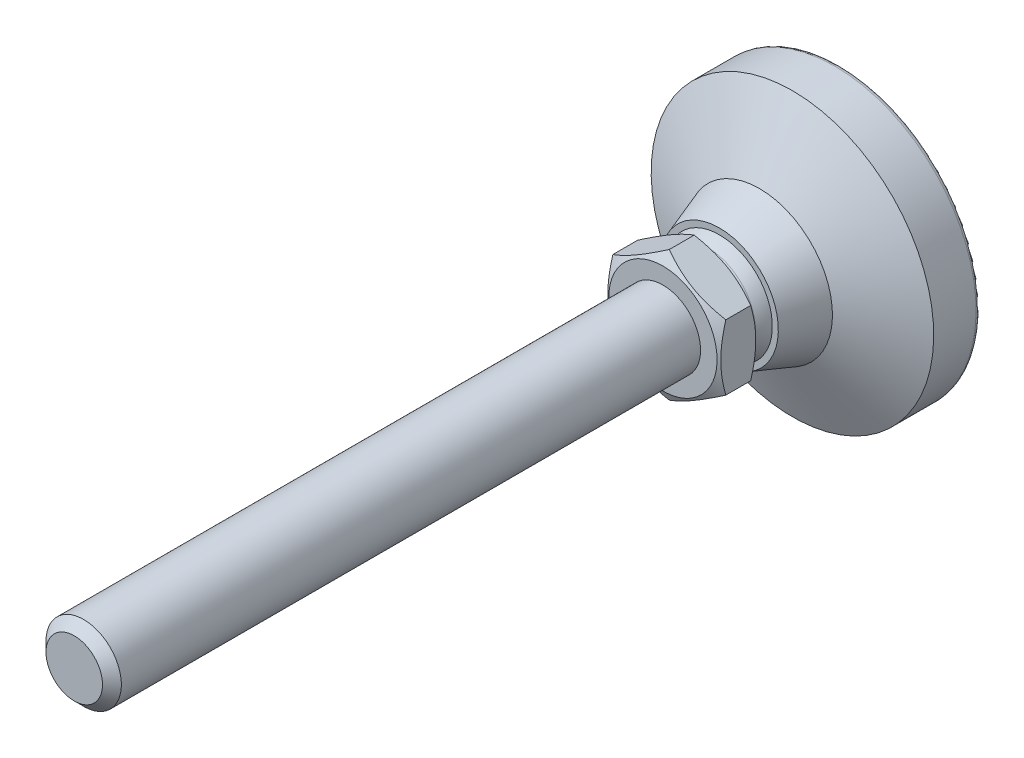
ISO-10303-21;
HEADER;
FILE_DESCRIPTION(('STEP AP214'),'2;1');
FILE_NAME('part.step','',(''),(''),'','','');
FILE_SCHEMA(('AUTOMOTIVE_DESIGN { 1 0 10303 214 1 1 1 1 }'));
ENDSEC;
DATA;
#1=APPLICATION_CONTEXT('core data for automotive mechanical design processes');
#2=APPLICATION_PROTOCOL_DEFINITION('international standard','automotive_design',2000,#1);
#3=PRODUCT_CONTEXT('',#1,'mechanical');
#4=PRODUCT('Part','Part','',(#3));
#5=PRODUCT_RELATED_PRODUCT_CATEGORY('part','',(#4));
#6=PRODUCT_DEFINITION_FORMATION('','',#4);
#7=PRODUCT_DEFINITION_CONTEXT('part definition',#1,'design');
#8=PRODUCT_DEFINITION('design','',#6,#7);
#9=PRODUCT_DEFINITION_SHAPE('','',#8);
#10=(LENGTH_UNIT() NAMED_UNIT(*) SI_UNIT(.MILLI.,.METRE.));
#11=(NAMED_UNIT(*) PLANE_ANGLE_UNIT() SI_UNIT($,.RADIAN.));
#12=(NAMED_UNIT(*) SI_UNIT($,.STERADIAN.) SOLID_ANGLE_UNIT());
#13=UNCERTAINTY_MEASURE_WITH_UNIT(LENGTH_MEASURE(1.E-05),#10,'distance_accuracy_value','');
#14=(GEOMETRIC_REPRESENTATION_CONTEXT(3) GLOBAL_UNCERTAINTY_ASSIGNED_CONTEXT((#13)) GLOBAL_UNIT_ASSIGNED_CONTEXT((#10,
#11,#12)) REPRESENTATION_CONTEXT('',''));
#15=CARTESIAN_POINT('',(0.,0.,0.));
#16=DIRECTION('',(0.,0.,1.));
#17=DIRECTION('',(1.,0.,0.));
#18=AXIS2_PLACEMENT_3D('',#15,#16,#17);
#19=CARTESIAN_POINT('',(-11.0000001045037,0.,29.4999999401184));
#20=DIRECTION('',(0.,0.,1.));
#21=DIRECTION('',(0.,-1.,0.));
#22=AXIS2_PLACEMENT_3D('',#19,#20,#21);
#23=PLANE('',#22);
#24=CARTESIAN_POINT('',(0.,0.,29.4999999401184));
#25=DIRECTION('',(0.,0.,-1.));
#26=DIRECTION('',(0.,1.,0.));
#27=AXIS2_PLACEMENT_3D('',#24,#25,#26);
#28=CIRCLE('',#27,11.5);
#29=CARTESIAN_POINT('',(0.,11.5,29.4999999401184));
#30=VERTEX_POINT('',#29);
#31=EDGE_CURVE('E79',#30,#30,#28,.T.);
#32=ORIENTED_EDGE('',*,*,#31,.T.);
#33=EDGE_LOOP('',(#32));
#34=FACE_BOUND('',#33,.T.);
#35=CARTESIAN_POINT('',(0.,0.,29.4999999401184));
#36=DIRECTION('',(0.,0.,-1.));
#37=DIRECTION('',(0.,1.,0.));
#38=AXIS2_PLACEMENT_3D('',#35,#36,#37);
#39=CIRCLE('',#38,11.0000001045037);
#40=CARTESIAN_POINT('',(0.,11.0000001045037,29.4999999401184));
#41=VERTEX_POINT('',#40);
#42=EDGE_CURVE('E73',#41,#41,#39,.T.);
#43=ORIENTED_EDGE('',*,*,#42,.F.);
#44=EDGE_LOOP('',(#43));
#45=FACE_BOUND('',#44,.T.);
#46=ADVANCED_FACE('F14',(#34,#45),#23,.F.);
#47=CARTESIAN_POINT('',(0.,0.,28.5000000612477));
#48=DIRECTION('',(0.,0.,-1.));
#49=DIRECTION('',(0.,1.,0.));
#50=AXIS2_PLACEMENT_3D('',#47,#48,#49);
#51=TOROIDAL_SURFACE('',#50,11.0000001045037,0.999999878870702);
#52=CARTESIAN_POINT('',(0.,0.,27.9943613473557));
#53=DIRECTION('',(0.,0.,-1.));
#54=DIRECTION('',(0.,1.,0.));
#55=AXIS2_PLACEMENT_3D('',#52,#53,#54);
#56=CIRCLE('',#55,10.1372549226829);
#57=CARTESIAN_POINT('',(-10.1372549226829,0.,27.9943613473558));
#58=VERTEX_POINT('',#57);
#59=EDGE_CURVE('E123',#58,#58,#56,.T.);
#60=ORIENTED_EDGE('',*,*,#59,.F.);
#61=EDGE_LOOP('',(#60));
#62=FACE_BOUND('',#61,.T.);
#63=ORIENTED_EDGE('',*,*,#42,.T.);
#64=EDGE_LOOP('',(#63));
#65=FACE_BOUND('',#64,.T.);
#66=ADVANCED_FACE('F233',(#62,#65),#51,.F.);
#67=CARTESIAN_POINT('',(0.,0.,22.053102));
#68=DIRECTION('',(0.,0.,-1.));
#69=DIRECTION('',(-1.,0.,0.));
#70=AXIS2_PLACEMENT_3D('',#67,#68,#69);
#71=SPHERICAL_SURFACE('',#70,11.75);
#72=CARTESIAN_POINT('',(0.,0.,25.5000004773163));
#73=DIRECTION('',(0.,0.,-1.));
#74=DIRECTION('',(0.,1.,0.));
#75=AXIS2_PLACEMENT_3D('',#72,#73,#74);
#76=CIRCLE('',#75,11.2330490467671);
#77=CARTESIAN_POINT('',(-11.2330490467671,0.,25.5000004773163));
#78=VERTEX_POINT('',#77);
#79=EDGE_CURVE('E120',#78,#78,#76,.T.);
#80=CARTESIAN_POINT('',(-11.2330490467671,0.,25.5000004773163));
#81=CARTESIAN_POINT('',(-11.2247050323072,0.,25.5271926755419));
#82=CARTESIAN_POINT('',(-11.2162622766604,0.,25.5543545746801));
#83=CARTESIAN_POINT('',(-11.1991797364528,0.,25.6086163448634));
#84=CARTESIAN_POINT('',(-11.190539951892,0.,25.6357162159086));
#85=CARTESIAN_POINT('',(-11.1730638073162,0.,25.6898524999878));
#86=CARTESIAN_POINT('',(-11.1642274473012,0.,25.7168889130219));
#87=CARTESIAN_POINT('',(-11.1463586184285,0.,25.7708968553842));
#88=CARTESIAN_POINT('',(-11.1373261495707,0.,25.7978683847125));
#89=CARTESIAN_POINT('',(-11.1190655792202,0.,25.8517451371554));
#90=CARTESIAN_POINT('',(-11.1098374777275,0.,25.8786503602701));
#91=CARTESIAN_POINT('',(-11.0911861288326,0.,25.9323930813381));
#92=CARTESIAN_POINT('',(-11.0817628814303,0.,25.9592305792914));
#93=CARTESIAN_POINT('',(-11.0627217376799,0.,26.0128364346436));
#94=CARTESIAN_POINT('',(-11.0531038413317,0.,26.0396047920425));
#95=CARTESIAN_POINT('',(-11.0336739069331,0.,26.0930709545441));
#96=CARTESIAN_POINT('',(-11.0238618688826,0.,26.1197687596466));
#97=CARTESIAN_POINT('',(-11.0040441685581,0.,26.1730924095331));
#98=CARTESIAN_POINT('',(-10.994038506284,0.,26.1997182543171));
#99=CARTESIAN_POINT('',(-10.9738340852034,0.,26.2528965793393));
#100=CARTESIAN_POINT('',(-10.963635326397,0.,26.2794490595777));
#101=CARTESIAN_POINT('',(-10.9430452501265,0.,26.332479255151));
#102=CARTESIAN_POINT('',(-10.9326539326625,0.,26.358956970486));
#103=CARTESIAN_POINT('',(-10.9116792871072,0.,26.411836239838));
#104=CARTESIAN_POINT('',(-10.9010959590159,0.,26.438237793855));
#105=CARTESIAN_POINT('',(-10.8797378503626,0.,26.4909633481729));
#106=CARTESIAN_POINT('',(-10.8689630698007,0.,26.5172873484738));
#107=CARTESIAN_POINT('',(-10.8472226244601,0.,26.5698564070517));
#108=CARTESIAN_POINT('',(-10.8362569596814,0.,26.5961014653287));
#109=CARTESIAN_POINT('',(-10.8141353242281,0.,26.6485112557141));
#110=CARTESIAN_POINT('',(-10.8029793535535,0.,26.6746759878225));
#111=CARTESIAN_POINT('',(-10.7804776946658,0.,26.7269237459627));
#112=CARTESIAN_POINT('',(-10.7691320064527,0.,26.7530067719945));
#113=CARTESIAN_POINT('',(-10.7462515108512,0.,26.8050897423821));
#114=CARTESIAN_POINT('',(-10.7347167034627,0.,26.831089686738));
#115=CARTESIAN_POINT('',(-10.7114585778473,0.,26.8830051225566));
#116=CARTESIAN_POINT('',(-10.6997352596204,0.,26.9089206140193));
#117=CARTESIAN_POINT('',(-10.6761007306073,0.,26.9606657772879));
#118=CARTESIAN_POINT('',(-10.6641895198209,0.,26.9864954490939));
#119=CARTESIAN_POINT('',(-10.6401798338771,0.,27.0380676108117));
#120=CARTESIAN_POINT('',(-10.6280813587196,0.,27.0638101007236));
#121=CARTESIAN_POINT('',(-10.6036977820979,0.,27.1152065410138));
#122=CARTESIAN_POINT('',(-10.5914126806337,0.,27.1408604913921));
#123=CARTESIAN_POINT('',(-10.5666564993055,0.,27.1920784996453));
#124=CARTESIAN_POINT('',(-10.5541854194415,0.,27.2176425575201));
#125=CARTESIAN_POINT('',(-10.5290579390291,0.,27.268679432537));
#126=CARTESIAN_POINT('',(-10.5164015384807,0.,27.2941522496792));
#127=CARTESIAN_POINT('',(-10.4909040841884,0.,27.3450052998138));
#128=CARTESIAN_POINT('',(-10.4780630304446,0.,27.3703855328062));
#129=CARTESIAN_POINT('',(-10.4521969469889,0.,27.4210520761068));
#130=CARTESIAN_POINT('',(-10.439171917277,0.,27.446338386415));
#131=CARTESIAN_POINT('',(-10.4129385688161,0.,27.4968157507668));
#132=CARTESIAN_POINT('',(-10.3997302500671,0.,27.5220068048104));
#133=CARTESIAN_POINT('',(-10.3731310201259,0.,27.572292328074));
#134=CARTESIAN_POINT('',(-10.3597401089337,0.,27.5973867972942));
#135=CARTESIAN_POINT('',(-10.3327764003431,0.,27.6474778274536));
#136=CARTESIAN_POINT('',(-10.3192036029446,0.,27.6724743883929));
#137=CARTESIAN_POINT('',(-10.2918768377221,0.,27.7223682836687));
#138=CARTESIAN_POINT('',(-10.2781228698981,0.,27.7472656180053));
#139=CARTESIAN_POINT('',(-10.2504344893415,0.,27.7969597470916));
#140=CARTESIAN_POINT('',(-10.2365000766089,0.,27.8217565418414));
#141=CARTESIAN_POINT('',(-10.2084515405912,0.,27.8712482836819));
#142=CARTESIAN_POINT('',(-10.1943374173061,0.,27.8959432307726));
#143=CARTESIAN_POINT('',(-10.1659302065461,0.,27.9452299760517));
#144=CARTESIAN_POINT('',(-10.1516371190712,0.,27.9698217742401));
#145=CARTESIAN_POINT('',(-10.1372549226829,0.,27.9943613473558));
#146=B_SPLINE_CURVE_WITH_KNOTS('',3,(#80,#81,#82,#83,#84,#85,#86,#87,#88,#89,#90,#91,#92,#93,
#94,#95,#96,#97,#98,#99,#100,#101,#102,#103,#104,#105,#106,#107,#108,#109,#110,#111,#112,#113,
#114,#115,#116,#117,#118,#119,#120,#121,#122,#123,#124,#125,#126,#127,#128,#129,#130,#131,#132,
#133,#134,#135,#136,#137,#138,#139,#140,#141,#142,#143,#144,#145),.UNSPECIFIED.,.F.,.F.,(4,2,2,
2,2,2,2,2,2,2,2,2,2,2,2,2,2,2,2,2,2,2,2,2,2,2,2,2,2,2,2,2,4),(0.,0.0853306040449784,
0.170661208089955,0.255991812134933,0.341322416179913,0.42665302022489,0.511983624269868,
0.597314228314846,0.682644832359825,0.767975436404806,0.853306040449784,0.93863664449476,
1.02396724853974,1.10929785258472,1.19462845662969,1.27995906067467,1.36528966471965,
1.45062026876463,1.53595087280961,1.62128147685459,1.70661208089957,1.79194268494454,
1.87727328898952,1.9626038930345,2.04793449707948,2.13326510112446,2.21859570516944,
2.30392630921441,2.38925691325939,2.47458751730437,2.55991812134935,2.64524872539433,
2.73057932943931),.UNSPECIFIED.);
#147=EDGE_CURVE('BSEAM240',#78,#58,#146,.T.);
#148=ORIENTED_EDGE('',*,*,#79,.F.);
#149=ORIENTED_EDGE('',*,*,#59,.T.);
#150=ORIENTED_EDGE('',*,*,#147,.T.);
#151=ORIENTED_EDGE('',*,*,#147,.F.);
#152=EDGE_LOOP('',(#148,#150,#149,#151));
#153=FACE_BOUND('',#152,.T.);
#154=ADVANCED_FACE('F240',(#153),#71,.T.);
#155=CARTESIAN_POINT('',(-11.2330490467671,0.,25.5000004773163));
#156=DIRECTION('',(0.,0.,-1.));
#157=DIRECTION('',(0.,1.,0.));
#158=AXIS2_PLACEMENT_3D('',#155,#156,#157);
#159=PLANE('',#158);
#160=CARTESIAN_POINT('',(0.,0.,25.5));
#161=DIRECTION('',(0.,0.,-1.));
#162=DIRECTION('',(0.,1.,0.));
#163=AXIS2_PLACEMENT_3D('',#160,#161,#162);
#164=CIRCLE('',#163,12.5);
#165=CARTESIAN_POINT('',(0.,12.5,25.5));
#166=VERTEX_POINT('',#165);
#167=EDGE_CURVE('E117',#166,#166,#164,.T.);
#168=ORIENTED_EDGE('',*,*,#167,.F.);
#169=EDGE_LOOP('',(#168));
#170=FACE_BOUND('',#169,.T.);
#171=ORIENTED_EDGE('',*,*,#79,.T.);
#172=EDGE_LOOP('',(#171));
#173=FACE_BOUND('',#172,.T.);
#174=ADVANCED_FACE('F372',(#170,#173),#159,.F.);
#175=CARTESIAN_POINT('',(0.,0.,25.5));
#176=DIRECTION('',(0.,0.,-1.));
#177=DIRECTION('',(0.,1.,0.));
#178=AXIS2_PLACEMENT_3D('',#175,#176,#177);
#179=CONICAL_SURFACE('',#178,12.5,0.339292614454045);
#180=CARTESIAN_POINT('',(0.,0.,17.));
#181=DIRECTION('',(0.,0.,-1.));
#182=DIRECTION('',(0.,1.,0.));
#183=AXIS2_PLACEMENT_3D('',#180,#181,#182);
#184=CIRCLE('',#183,15.5);
#185=CARTESIAN_POINT('',(0.,15.5,17.));
#186=VERTEX_POINT('',#185);
#187=EDGE_CURVE('E114',#186,#186,#184,.T.);
#188=ORIENTED_EDGE('',*,*,#187,.F.);
#189=EDGE_LOOP('',(#188));
#190=FACE_BOUND('',#189,.T.);
#191=ORIENTED_EDGE('',*,*,#167,.T.);
#192=EDGE_LOOP('',(#191));
#193=FACE_BOUND('',#192,.T.);
#194=ADVANCED_FACE('F362',(#190,#193),#179,.T.);
#195=CARTESIAN_POINT('',(0.,0.,17.));
#196=DIRECTION('',(0.,0.,-1.));
#197=DIRECTION('',(0.,1.,0.));
#198=AXIS2_PLACEMENT_3D('',#195,#196,#197);
#199=CONICAL_SURFACE('',#198,15.5,1.12103671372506);
#200=CARTESIAN_POINT('',(0.,0.,10.));
#201=DIRECTION('',(0.,0.,-1.));
#202=DIRECTION('',(0.,1.,0.));
#203=AXIS2_PLACEMENT_3D('',#200,#201,#202);
#204=CIRCLE('',#203,30.);
#205=CARTESIAN_POINT('',(0.,30.,10.));
#206=VERTEX_POINT('',#205);
#207=EDGE_CURVE('E111',#206,#206,#204,.T.);
#208=ORIENTED_EDGE('',*,*,#207,.F.);
#209=EDGE_LOOP('',(#208));
#210=FACE_BOUND('',#209,.T.);
#211=ORIENTED_EDGE('',*,*,#187,.T.);
#212=EDGE_LOOP('',(#211));
#213=FACE_BOUND('',#212,.T.);
#214=ADVANCED_FACE('F352',(#210,#213),#199,.T.);
#215=CARTESIAN_POINT('',(0.,0.,0.));
#216=DIRECTION('',(0.,0.,-1.));
#217=DIRECTION('',(0.,1.,0.));
#218=AXIS2_PLACEMENT_3D('',#215,#216,#217);
#219=CYLINDRICAL_SURFACE('',#218,30.);
#220=CARTESIAN_POINT('',(0.,0.,1.));
#221=DIRECTION('',(0.,0.,-1.));
#222=DIRECTION('',(0.,1.,0.));
#223=AXIS2_PLACEMENT_3D('',#220,#221,#222);
#224=CIRCLE('',#223,30.);
#225=CARTESIAN_POINT('',(0.,30.,1.));
#226=VERTEX_POINT('',#225);
#227=EDGE_CURVE('E88',#226,#226,#224,.T.);
#228=ORIENTED_EDGE('',*,*,#227,.F.);
#229=EDGE_LOOP('',(#228));
#230=FACE_BOUND('',#229,.T.);
#231=ORIENTED_EDGE('',*,*,#207,.T.);
#232=EDGE_LOOP('',(#231));
#233=FACE_BOUND('',#232,.T.);
#234=ADVANCED_FACE('F342',(#230,#233),#219,.T.);
#235=CARTESIAN_POINT('',(0.,0.,1.));
#236=DIRECTION('',(0.,0.,-1.));
#237=DIRECTION('',(0.,1.,0.));
#238=AXIS2_PLACEMENT_3D('',#235,#236,#237);
#239=TOROIDAL_SURFACE('',#238,29.,1.);
#240=CARTESIAN_POINT('',(0.,0.,0.));
#241=DIRECTION('',(0.,0.,-1.));
#242=DIRECTION('',(0.,1.,0.));
#243=AXIS2_PLACEMENT_3D('',#240,#241,#242);
#244=CIRCLE('',#243,29.);
#245=CARTESIAN_POINT('',(0.,29.,0.));
#246=VERTEX_POINT('',#245);
#247=EDGE_CURVE('E85',#246,#246,#244,.T.);
#248=ORIENTED_EDGE('',*,*,#247,.F.);
#249=EDGE_LOOP('',(#248));
#250=FACE_BOUND('',#249,.T.);
#251=ORIENTED_EDGE('',*,*,#227,.T.);
#252=EDGE_LOOP('',(#251));
#253=FACE_BOUND('',#252,.T.);
#254=ADVANCED_FACE('F332',(#250,#253),#239,.T.);
#255=CARTESIAN_POINT('',(-29.,0.,0.));
#256=DIRECTION('',(0.,0.,1.));
#257=DIRECTION('',(0.,-1.,0.));
#258=AXIS2_PLACEMENT_3D('',#255,#256,#257);
#259=PLANE('',#258);
#260=ORIENTED_EDGE('',*,*,#247,.T.);
#261=EDGE_LOOP('',(#260));
#262=FACE_BOUND('',#261,.T.);
#263=ADVANCED_FACE('F141',(#262),#259,.F.);
#264=CARTESIAN_POINT('',(0.,0.,31.6858038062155));
#265=DIRECTION('',(0.,0.,1.));
#266=DIRECTION('',(0.,-1.,0.));
#267=AXIS2_PLACEMENT_3D('',#264,#265,#266);
#268=CONICAL_SURFACE('',#267,15.2859233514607,1.04719755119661);
#269=CARTESIAN_POINT('',(-12.0002,6.92808776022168,30.8605385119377));
#270=CARTESIAN_POINT('',(-11.7364142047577,7.08038456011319,30.7726247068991));
#271=CARTESIAN_POINT('',(-11.4716448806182,7.23324920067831,30.6887010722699));
#272=CARTESIAN_POINT('',(-10.9399829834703,7.54020434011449,30.529941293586));
#273=CARTESIAN_POINT('',(-10.6730897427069,7.69429522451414,30.4551081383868));
#274=CARTESIAN_POINT('',(-9.86810959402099,8.15905073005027,30.2456926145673));
#275=CARTESIAN_POINT('',(-9.32684492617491,8.47155003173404,30.126578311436));
#276=CARTESIAN_POINT('',(-8.51686717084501,8.93919090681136,29.9869061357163));
#277=CARTESIAN_POINT('',(-8.25057389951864,9.09293539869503,29.9471188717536));
#278=CARTESIAN_POINT('',(-7.71675440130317,9.4011362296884,29.8803984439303));
#279=CARTESIAN_POINT('',(-7.44922815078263,9.55559258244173,29.853465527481));
#280=CARTESIAN_POINT('',(-6.91372963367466,9.86476279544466,29.8131436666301));
#281=CARTESIAN_POINT('',(-6.64575827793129,10.0194761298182,29.7997386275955));
#282=CARTESIAN_POINT('',(-6.10956726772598,10.3290461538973,29.7867581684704));
#283=CARTESIAN_POINT('',(-5.84134762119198,10.4839028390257,29.787182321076));
#284=CARTESIAN_POINT('',(-5.33991062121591,10.7734076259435,29.800895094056));
#285=CARTESIAN_POINT('',(-5.10665750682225,10.908076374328,29.8125110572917));
#286=CARTESIAN_POINT('',(-4.64068775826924,11.1771041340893,29.8459830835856));
#287=CARTESIAN_POINT('',(-4.40797116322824,11.3114631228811,29.8678398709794));
#288=CARTESIAN_POINT('',(-3.94320092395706,11.5797983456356,29.9214124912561));
#289=CARTESIAN_POINT('',(-3.711147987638,11.7137741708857,29.9531364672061));
#290=CARTESIAN_POINT('',(-3.24813003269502,11.9810977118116,30.0258868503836));
#291=CARTESIAN_POINT('',(-3.01716508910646,12.1144453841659,30.0669138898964));
#292=CARTESIAN_POINT('',(-2.31605804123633,12.5192297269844,30.204986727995));
#293=CARTESIAN_POINT('',(-1.84794625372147,12.789494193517,30.3157999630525));
#294=CARTESIAN_POINT('',(-0.918702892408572,13.3259930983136,30.5673008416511));
#295=CARTESIAN_POINT('',(-0.457559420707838,13.5922344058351,30.7079294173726));
#296=CARTESIAN_POINT('',(0.000200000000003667,13.8565219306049,30.8605385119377));
#297=B_SPLINE_CURVE_WITH_KNOTS('',3,(#269,#270,#271,#272,#273,#274,#275,#276,#277,#278,#279,
#280,#281,#282,#283,#284,#285,#286,#287,#288,#289,#290,#291,#292,#293,#294,#295,#296),
.UNSPECIFIED.,.F.,.F.,(4,2,2,2,2,2,2,2,2,2,2,2,2,4),(0.,0.951004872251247,1.90232158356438,
3.80900466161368,4.73894551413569,5.66890426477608,6.59775529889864,7.52657763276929,
8.33514643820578,9.14377244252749,9.95306755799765,10.7624176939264,12.4167102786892,
14.0677556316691),.UNSPECIFIED.);
#298=CARTESIAN_POINT('',(-12.,6.92820323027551,30.8604718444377));
#299=VERTEX_POINT('',#298);
#300=CARTESIAN_POINT('',(0.,13.856406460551,30.8604718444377));
#301=VERTEX_POINT('',#300);
#302=EDGE_CURVE('E29',#299,#301,#297,.T.);
#303=ORIENTED_EDGE('',*,*,#302,.T.);
#304=CARTESIAN_POINT('',(-0.000199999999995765,13.8565219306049,30.8605385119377));
#305=CARTESIAN_POINT('',(0.263585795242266,13.7042251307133,30.7726247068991));
#306=CARTESIAN_POINT('',(0.528355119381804,13.5513604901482,30.6887010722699));
#307=CARTESIAN_POINT('',(1.06001701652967,13.244405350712,30.529941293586));
#308=CARTESIAN_POINT('',(1.32691025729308,13.0903144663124,30.4551081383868));
#309=CARTESIAN_POINT('',(2.13189040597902,12.6255589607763,30.2456926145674));
#310=CARTESIAN_POINT('',(2.67315507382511,12.3130596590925,30.1265783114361));
#311=CARTESIAN_POINT('',(3.483132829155,11.8454187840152,29.9869061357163));
#312=CARTESIAN_POINT('',(3.74942610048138,11.6916742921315,29.9471188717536));
#313=CARTESIAN_POINT('',(4.28324559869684,11.3834734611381,29.8803984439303));
#314=CARTESIAN_POINT('',(4.55077184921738,11.2290171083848,29.853465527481));
#315=CARTESIAN_POINT('',(5.08627036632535,10.9198468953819,29.8131436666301));
#316=CARTESIAN_POINT('',(5.35424172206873,10.7651335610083,29.7997386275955));
#317=CARTESIAN_POINT('',(5.89043273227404,10.4555635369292,29.7867581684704));
#318=CARTESIAN_POINT('',(6.15865237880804,10.3007068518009,29.787182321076));
#319=CARTESIAN_POINT('',(6.66008937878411,10.0112020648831,29.800895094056));
#320=CARTESIAN_POINT('',(6.89334249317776,9.87653331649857,29.8125110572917));
#321=CARTESIAN_POINT('',(7.35931224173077,9.60750555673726,29.8459830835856));
#322=CARTESIAN_POINT('',(7.59202883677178,9.47314656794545,29.8678398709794));
#323=CARTESIAN_POINT('',(8.05679907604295,9.20481134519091,29.9214124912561));
#324=CARTESIAN_POINT('',(8.28885201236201,9.07083551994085,29.9531364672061));
#325=CARTESIAN_POINT('',(8.75186996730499,8.80351197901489,30.0258868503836));
#326=CARTESIAN_POINT('',(8.98283491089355,8.67016430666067,30.0669138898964));
#327=CARTESIAN_POINT('',(9.68394195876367,8.26537996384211,30.204986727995));
#328=CARTESIAN_POINT('',(10.1520537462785,7.99511549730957,30.3157999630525));
#329=CARTESIAN_POINT('',(11.0812971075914,7.45861659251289,30.5673008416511));
#330=CARTESIAN_POINT('',(11.5424405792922,7.19237528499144,30.7079294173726));
#331=CARTESIAN_POINT('',(12.0002,6.92808776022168,30.8605385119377));
#332=B_SPLINE_CURVE_WITH_KNOTS('',3,(#304,#305,#306,#307,#308,#309,#310,#311,#312,#313,#314,
#315,#316,#317,#318,#319,#320,#321,#322,#323,#324,#325,#326,#327,#328,#329,#330,#331),
.UNSPECIFIED.,.F.,.F.,(4,2,2,2,2,2,2,2,2,2,2,2,2,4),(0.,0.951004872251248,1.90232158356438,
3.80900466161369,4.7389455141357,5.66890426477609,6.59775529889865,7.5265776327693,
8.33514643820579,9.1437724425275,9.95306755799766,10.7624176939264,12.4167102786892,
14.0677556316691),.UNSPECIFIED.);
#333=CARTESIAN_POINT('',(12.,6.92820323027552,30.8604718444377));
#334=VERTEX_POINT('',#333);
#335=EDGE_CURVE('E66',#301,#334,#332,.T.);
#336=ORIENTED_EDGE('',*,*,#335,.T.);
#337=CARTESIAN_POINT('',(12.,18.4491557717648,35.5670495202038));
#338=CARTESIAN_POINT('',(12.,18.1877661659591,35.4405449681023));
#339=CARTESIAN_POINT('',(12.,17.9260654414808,35.3146835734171));
#340=CARTESIAN_POINT('',(12.,17.401976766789,35.064393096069));
#341=CARTESIAN_POINT('',(12.,17.1395888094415,34.9399640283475));
#342=CARTESIAN_POINT('',(12.,16.3512244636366,34.5690104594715));
#343=CARTESIAN_POINT('',(12.,15.8241274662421,34.3248583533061));
#344=CARTESIAN_POINT('',(12.,14.7634053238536,33.8430387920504));
#345=CARTESIAN_POINT('',(12.,14.2297601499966,33.6054153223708));
#346=CARTESIAN_POINT('',(12.,13.1581690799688,33.1401065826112));
#347=CARTESIAN_POINT('',(12.,12.6202233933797,32.9124208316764));
#348=CARTESIAN_POINT('',(12.,11.5224579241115,32.4627752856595));
#349=CARTESIAN_POINT('',(12.,10.9624758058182,32.2412097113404));
#350=CARTESIAN_POINT('',(12.,9.83589698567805,31.815239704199));
#351=CARTESIAN_POINT('',(12.,9.26929954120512,31.610837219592));
#352=CARTESIAN_POINT('',(12.,8.12972111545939,31.2246803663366));
#353=CARTESIAN_POINT('',(12.,7.55675628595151,31.0428787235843));
#354=CARTESIAN_POINT('',(12.,6.4025552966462,30.7078536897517));
#355=CARTESIAN_POINT('',(12.,5.82132185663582,30.5546211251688));
#356=CARTESIAN_POINT('',(12.,4.94477695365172,30.3522375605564));
#357=CARTESIAN_POINT('',(12.,4.65258618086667,30.2894830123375));
#358=CARTESIAN_POINT('',(12.,4.06623904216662,30.1738927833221));
#359=CARTESIAN_POINT('',(12.,3.77208271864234,30.121056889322));
#360=CARTESIAN_POINT('',(12.,3.18201834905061,30.026246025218));
#361=CARTESIAN_POINT('',(12.,2.8861103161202,29.9842709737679));
#362=CARTESIAN_POINT('',(12.,2.29287001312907,29.9120250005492));
#363=CARTESIAN_POINT('',(12.,1.99553779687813,29.8817536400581));
#364=CARTESIAN_POINT('',(12.,1.40367554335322,29.8338871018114));
#365=CARTESIAN_POINT('',(12.,1.1091582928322,29.8161347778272));
#366=CARTESIAN_POINT('',(12.,0.519638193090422,29.7930890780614));
#367=CARTESIAN_POINT('',(12.,0.224635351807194,29.7877955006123));
#368=CARTESIAN_POINT('',(12.,-0.365331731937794,29.7897927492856));
#369=CARTESIAN_POINT('',(12.,-0.660295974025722,29.7970836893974));
#370=CARTESIAN_POINT('',(12.,-1.24965982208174,29.8240749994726));
#371=CARTESIAN_POINT('',(12.,-1.54405940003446,29.8437759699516));
#372=CARTESIAN_POINT('',(12.,-2.2565344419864,29.906059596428));
#373=CARTESIAN_POINT('',(12.,-2.67408031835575,29.9548043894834));
#374=CARTESIAN_POINT('',(12.,-3.5059686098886,30.0745634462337));
#375=CARTESIAN_POINT('',(12.,-3.92031056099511,30.1455808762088));
#376=CARTESIAN_POINT('',(12.,-4.74543197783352,30.3073585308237));
#377=CARTESIAN_POINT('',(12.,-5.15620830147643,30.3981346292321));
#378=CARTESIAN_POINT('',(12.,-5.97358990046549,30.5966691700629));
#379=CARTESIAN_POINT('',(12.,-6.38019524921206,30.704427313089));
#380=CARTESIAN_POINT('',(12.,-7.19808575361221,30.936835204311));
#381=CARTESIAN_POINT('',(12.,-7.60928038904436,31.0618013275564));
#382=CARTESIAN_POINT('',(12.,-8.42761754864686,31.3242965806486));
#383=CARTESIAN_POINT('',(12.,-8.83476004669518,31.461825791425));
#384=CARTESIAN_POINT('',(12.,-9.64520027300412,31.7472942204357));
#385=CARTESIAN_POINT('',(12.,-10.0484993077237,31.8952297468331));
#386=CARTESIAN_POINT('',(12.,-10.8517789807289,32.1998046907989));
#387=CARTESIAN_POINT('',(12.,-11.2517596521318,32.3564440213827));
#388=CARTESIAN_POINT('',(12.,-12.1712967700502,32.7262469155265));
#389=CARTESIAN_POINT('',(12.,-12.6898161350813,32.9419848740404));
#390=CARTESIAN_POINT('',(12.,-13.7226553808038,33.3833163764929));
#391=CARTESIAN_POINT('',(12.,-14.2369750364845,33.60891044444));
#392=CARTESIAN_POINT('',(12.,-15.2621664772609,34.0680449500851));
#393=CARTESIAN_POINT('',(12.,-15.7730375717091,34.3015869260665));
#394=CARTESIAN_POINT('',(12.,-16.7917880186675,34.7750688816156));
#395=CARTESIAN_POINT('',(12.,-17.2996674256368,35.0150087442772));
#396=CARTESIAN_POINT('',(12.,-18.3134153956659,35.5003675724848));
#397=CARTESIAN_POINT('',(12.,-18.8192814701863,35.7457917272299));
#398=CARTESIAN_POINT('',(12.,-19.8288855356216,36.240977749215));
#399=CARTESIAN_POINT('',(12.,-20.332623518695,36.4907396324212));
#400=CARTESIAN_POINT('',(12.,-21.3382321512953,36.9938506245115));
#401=CARTESIAN_POINT('',(12.,-21.8401030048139,37.2471993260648));
#402=CARTESIAN_POINT('',(12.,-22.8422969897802,37.7569413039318));
#403=CARTESIAN_POINT('',(12.,-23.342620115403,38.0133345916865));
#404=CARTESIAN_POINT('',(12.,-24.7618922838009,38.7452634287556));
#405=CARTESIAN_POINT('',(12.,-25.6792591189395,39.2238670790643));
#406=CARTESIAN_POINT('',(12.,-27.5105752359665,40.1876216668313));
#407=CARTESIAN_POINT('',(12.,-28.4245244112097,40.6727728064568));
#408=CARTESIAN_POINT('',(12.,-30.2476486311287,41.6470046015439));
#409=CARTESIAN_POINT('',(12.,-31.1568298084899,42.1360737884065));
#410=CARTESIAN_POINT('',(12.,-32.5189771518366,42.872623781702));
#411=CARTESIAN_POINT('',(12.,-32.9727443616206,43.1186253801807));
#412=CARTESIAN_POINT('',(12.,-33.8797970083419,43.6115135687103));
#413=CARTESIAN_POINT('',(12.,-34.3330824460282,43.8584001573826));
#414=CARTESIAN_POINT('',(12.,-34.7861537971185,44.1056791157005));
#415=B_SPLINE_CURVE_WITH_KNOTS('',3,(#337,#338,#339,#340,#341,#342,#343,#344,#345,#346,#347,
#348,#349,#350,#351,#352,#353,#354,#355,#356,#357,#358,#359,#360,#361,#362,#363,#364,#365,#366,
#367,#368,#369,#370,#371,#372,#373,#374,#375,#376,#377,#378,#379,#380,#381,#382,#383,#384,#385,
#386,#387,#388,#389,#390,#391,#392,#393,#394,#395,#396,#397,#398,#399,#400,#401,#402,#403,#404,
#405,#406,#407,#408,#409,#410,#411,#412,#413,#414),.UNSPECIFIED.,.F.,.F.,(4,2,2,2,2,2,2,2,2,2,2,
2,2,2,2,2,2,2,2,2,2,2,2,2,2,2,2,2,2,2,2,2,2,2,2,2,2,2,4),(0.,0.871176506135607,1.74236209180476,
3.4849995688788,5.23739860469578,6.98971275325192,8.79616385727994,10.6028197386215,
12.4056306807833,14.2078617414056,15.1042819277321,16.0006828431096,16.8970770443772,
17.7934376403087,18.6783360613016,19.5632201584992,20.4481122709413,21.3330472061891,
22.5934906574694,23.854113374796,25.1157526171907,26.3773696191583,27.6664225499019,
28.955483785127,30.2440899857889,31.5326833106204,33.2173759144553,34.9021581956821,
36.5872684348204,38.2723479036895,39.9590956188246,41.6458495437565,43.3324134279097,
45.0189836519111,48.1230718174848,51.2272560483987,54.3243691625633,55.872849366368,
57.4213271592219),.UNSPECIFIED.);
#416=CARTESIAN_POINT('',(12.,-6.9282032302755,30.8604718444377));
#417=VERTEX_POINT('',#416);
#418=EDGE_CURVE('E69',#334,#417,#415,.T.);
#419=ORIENTED_EDGE('',*,*,#418,.T.);
#420=CARTESIAN_POINT('',(12.0002,-6.92808776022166,30.8605385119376));
#421=CARTESIAN_POINT('',(11.7364142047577,-7.08038456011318,30.772624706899));
#422=CARTESIAN_POINT('',(11.4716448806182,-7.2332492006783,30.6887010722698));
#423=CARTESIAN_POINT('',(10.9399829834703,-7.54020434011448,30.529941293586));
#424=CARTESIAN_POINT('',(10.6730897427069,-7.69429522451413,30.4551081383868));
#425=CARTESIAN_POINT('',(9.86810959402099,-8.15905073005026,30.2456926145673));
#426=CARTESIAN_POINT('',(9.3268449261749,-8.47155003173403,30.126578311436));
#427=CARTESIAN_POINT('',(8.51686717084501,-8.93919090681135,29.9869061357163));
#428=CARTESIAN_POINT('',(8.25057389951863,-9.09293539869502,29.9471188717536));
#429=CARTESIAN_POINT('',(7.71675440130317,-9.40113622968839,29.8803984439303));
#430=CARTESIAN_POINT('',(7.44922815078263,-9.55559258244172,29.853465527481));
#431=CARTESIAN_POINT('',(6.91372963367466,-9.86476279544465,29.8131436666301));
#432=CARTESIAN_POINT('',(6.64575827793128,-10.0194761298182,29.7997386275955));
#433=CARTESIAN_POINT('',(6.10956726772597,-10.3290461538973,29.7867581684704));
#434=CARTESIAN_POINT('',(5.84134762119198,-10.4839028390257,29.787182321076));
#435=CARTESIAN_POINT('',(5.33991062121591,-10.7734076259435,29.800895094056));
#436=CARTESIAN_POINT('',(5.10665750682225,-10.908076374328,29.8125110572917));
#437=CARTESIAN_POINT('',(4.64068775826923,-11.1771041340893,29.8459830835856));
#438=CARTESIAN_POINT('',(4.40797116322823,-11.3114631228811,29.8678398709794));
#439=CARTESIAN_POINT('',(3.94320092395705,-11.5797983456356,29.9214124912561));
#440=CARTESIAN_POINT('',(3.71114798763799,-11.7137741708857,29.9531364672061));
#441=CARTESIAN_POINT('',(3.24813003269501,-11.9810977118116,30.0258868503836));
#442=CARTESIAN_POINT('',(3.01716508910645,-12.1144453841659,30.0669138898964));
#443=CARTESIAN_POINT('',(2.31605804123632,-12.5192297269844,30.204986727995));
#444=CARTESIAN_POINT('',(1.84794625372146,-12.789494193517,30.3157999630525));
#445=CARTESIAN_POINT('',(0.918702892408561,-13.3259930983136,30.5673008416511));
#446=CARTESIAN_POINT('',(0.457559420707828,-13.5922344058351,30.7079294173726));
#447=CARTESIAN_POINT('',(-0.000200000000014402,-13.8565219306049,30.8605385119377));
#448=B_SPLINE_CURVE_WITH_KNOTS('',3,(#420,#421,#422,#423,#424,#425,#426,#427,#428,#429,#430,
#431,#432,#433,#434,#435,#436,#437,#438,#439,#440,#441,#442,#443,#444,#445,#446,#447),
.UNSPECIFIED.,.F.,.F.,(4,2,2,2,2,2,2,2,2,2,2,2,2,4),(0.,0.951004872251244,1.90232158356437,
3.80900466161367,4.73894551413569,5.66890426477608,6.59775529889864,7.52657763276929,
8.33514643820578,9.14377244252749,9.95306755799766,10.7624176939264,12.4167102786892,
14.0677556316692),.UNSPECIFIED.);
#449=CARTESIAN_POINT('',(0.,-13.856406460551,30.8604718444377));
#450=VERTEX_POINT('',#449);
#451=EDGE_CURVE('E78',#417,#450,#448,.T.);
#452=ORIENTED_EDGE('',*,*,#451,.T.);
#453=CARTESIAN_POINT('',(0.000199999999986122,-13.8565219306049,30.8605385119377));
#454=CARTESIAN_POINT('',(-0.263585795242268,-13.7042251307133,30.7726247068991));
#455=CARTESIAN_POINT('',(-0.528355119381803,-13.5513604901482,30.6887010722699));
#456=CARTESIAN_POINT('',(-1.06001701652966,-13.244405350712,30.529941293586));
#457=CARTESIAN_POINT('',(-1.32691025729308,-13.0903144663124,30.4551081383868));
#458=CARTESIAN_POINT('',(-2.13189040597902,-12.6255589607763,30.2456926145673));
#459=CARTESIAN_POINT('',(-2.67315507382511,-12.3130596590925,30.126578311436));
#460=CARTESIAN_POINT('',(-3.483132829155,-11.8454187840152,29.9869061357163));
#461=CARTESIAN_POINT('',(-3.74942610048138,-11.6916742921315,29.9471188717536));
#462=CARTESIAN_POINT('',(-4.28324559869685,-11.3834734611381,29.8803984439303));
#463=CARTESIAN_POINT('',(-4.55077184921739,-11.2290171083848,29.853465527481));
#464=CARTESIAN_POINT('',(-5.08627036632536,-10.9198468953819,29.8131436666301));
#465=CARTESIAN_POINT('',(-5.35424172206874,-10.7651335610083,29.7997386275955));
#466=CARTESIAN_POINT('',(-5.89043273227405,-10.4555635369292,29.7867581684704));
#467=CARTESIAN_POINT('',(-6.15865237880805,-10.3007068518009,29.787182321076));
#468=CARTESIAN_POINT('',(-6.66008937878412,-10.011202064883,29.800895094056));
#469=CARTESIAN_POINT('',(-6.89334249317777,-9.87653331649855,29.8125110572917));
#470=CARTESIAN_POINT('',(-7.35931224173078,-9.60750555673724,29.8459830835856));
#471=CARTESIAN_POINT('',(-7.59202883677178,-9.47314656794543,29.8678398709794));
#472=CARTESIAN_POINT('',(-8.05679907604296,-9.20481134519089,29.9214124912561));
#473=CARTESIAN_POINT('',(-8.28885201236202,-9.07083551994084,29.9531364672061));
#474=CARTESIAN_POINT('',(-8.75186996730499,-8.80351197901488,30.0258868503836));
#475=CARTESIAN_POINT('',(-8.98283491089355,-8.67016430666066,30.0669138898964));
#476=CARTESIAN_POINT('',(-9.68394195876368,-8.2653799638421,30.204986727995));
#477=CARTESIAN_POINT('',(-10.1520537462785,-7.99511549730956,30.3157999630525));
#478=CARTESIAN_POINT('',(-11.0812971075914,-7.45861659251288,30.5673008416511));
#479=CARTESIAN_POINT('',(-11.5424405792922,-7.19237528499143,30.7079294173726));
#480=CARTESIAN_POINT('',(-12.0002,-6.92808776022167,30.8605385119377));
#481=B_SPLINE_CURVE_WITH_KNOTS('',3,(#453,#454,#455,#456,#457,#458,#459,#460,#461,#462,#463,
#464,#465,#466,#467,#468,#469,#470,#471,#472,#473,#474,#475,#476,#477,#478,#479,#480),
.UNSPECIFIED.,.F.,.F.,(4,2,2,2,2,2,2,2,2,2,2,2,2,4),(0.,0.951004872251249,1.90232158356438,
3.80900466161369,4.73894551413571,5.6689042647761,6.59775529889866,7.52657763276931,
8.3351464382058,9.1437724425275,9.95306755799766,10.7624176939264,12.4167102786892,
14.0677556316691),.UNSPECIFIED.);
#482=CARTESIAN_POINT('',(-12.,-6.92820323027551,30.8604718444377));
#483=VERTEX_POINT('',#482);
#484=EDGE_CURVE('E165',#450,#483,#481,.T.);
#485=ORIENTED_EDGE('',*,*,#484,.T.);
#486=CARTESIAN_POINT('',(-12.,18.4491557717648,35.5670495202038));
#487=CARTESIAN_POINT('',(-12.,18.1877661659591,35.4405449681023));
#488=CARTESIAN_POINT('',(-12.,17.9260654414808,35.3146835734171));
#489=CARTESIAN_POINT('',(-12.,17.401976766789,35.064393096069));
#490=CARTESIAN_POINT('',(-12.,17.1395888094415,34.9399640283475));
#491=CARTESIAN_POINT('',(-12.,16.3512244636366,34.5690104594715));
#492=CARTESIAN_POINT('',(-12.,15.8241274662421,34.3248583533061));
#493=CARTESIAN_POINT('',(-12.,14.7634053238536,33.8430387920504));
#494=CARTESIAN_POINT('',(-12.,14.2297601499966,33.6054153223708));
#495=CARTESIAN_POINT('',(-12.,13.1581690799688,33.1401065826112));
#496=CARTESIAN_POINT('',(-12.,12.6202233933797,32.9124208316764));
#497=CARTESIAN_POINT('',(-12.,11.5224579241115,32.4627752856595));
#498=CARTESIAN_POINT('',(-12.,10.9624758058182,32.2412097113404));
#499=CARTESIAN_POINT('',(-12.,9.83589698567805,31.815239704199));
#500=CARTESIAN_POINT('',(-12.,9.26929954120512,31.610837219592));
#501=CARTESIAN_POINT('',(-12.,8.12972111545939,31.2246803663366));
#502=CARTESIAN_POINT('',(-12.,7.55675628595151,31.0428787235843));
#503=CARTESIAN_POINT('',(-12.,6.4025552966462,30.7078536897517));
#504=CARTESIAN_POINT('',(-12.,5.82132185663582,30.5546211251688));
#505=CARTESIAN_POINT('',(-12.,4.94477695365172,30.3522375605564));
#506=CARTESIAN_POINT('',(-12.,4.65258618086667,30.2894830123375));
#507=CARTESIAN_POINT('',(-12.,4.06623904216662,30.1738927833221));
#508=CARTESIAN_POINT('',(-12.,3.77208271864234,30.121056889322));
#509=CARTESIAN_POINT('',(-12.,3.18201834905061,30.026246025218));
#510=CARTESIAN_POINT('',(-12.,2.88611031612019,29.9842709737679));
#511=CARTESIAN_POINT('',(-12.,2.29287001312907,29.9120250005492));
#512=CARTESIAN_POINT('',(-12.,1.99553779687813,29.8817536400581));
#513=CARTESIAN_POINT('',(-12.,1.40367554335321,29.8338871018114));
#514=CARTESIAN_POINT('',(-12.,1.10915829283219,29.8161347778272));
#515=CARTESIAN_POINT('',(-12.,0.519638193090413,29.7930890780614));
#516=CARTESIAN_POINT('',(-12.,0.224635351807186,29.7877955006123));
#517=CARTESIAN_POINT('',(-12.,-0.365331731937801,29.7897927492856));
#518=CARTESIAN_POINT('',(-12.,-0.660295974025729,29.7970836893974));
#519=CARTESIAN_POINT('',(-12.,-1.24965982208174,29.8240749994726));
#520=CARTESIAN_POINT('',(-12.,-1.54405940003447,29.8437759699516));
#521=CARTESIAN_POINT('',(-12.,-2.25653444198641,29.906059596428));
#522=CARTESIAN_POINT('',(-12.,-2.67408031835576,29.9548043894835));
#523=CARTESIAN_POINT('',(-12.,-3.50596860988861,30.0745634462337));
#524=CARTESIAN_POINT('',(-12.,-3.92031056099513,30.1455808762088));
#525=CARTESIAN_POINT('',(-12.,-4.74543197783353,30.3073585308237));
#526=CARTESIAN_POINT('',(-12.,-5.15620830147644,30.3981346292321));
#527=CARTESIAN_POINT('',(-12.,-5.9735899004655,30.5966691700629));
#528=CARTESIAN_POINT('',(-12.,-6.38019524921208,30.7044273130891));
#529=CARTESIAN_POINT('',(-12.,-7.19808575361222,30.936835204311));
#530=CARTESIAN_POINT('',(-12.,-7.60928038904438,31.0618013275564));
#531=CARTESIAN_POINT('',(-12.,-8.42761754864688,31.3242965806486));
#532=CARTESIAN_POINT('',(-12.,-8.83476004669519,31.461825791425));
#533=CARTESIAN_POINT('',(-12.,-9.64520027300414,31.7472942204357));
#534=CARTESIAN_POINT('',(-12.,-10.0484993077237,31.8952297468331));
#535=CARTESIAN_POINT('',(-12.,-10.8517789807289,32.1998046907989));
#536=CARTESIAN_POINT('',(-12.,-11.2517596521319,32.3564440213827));
#537=CARTESIAN_POINT('',(-12.,-12.1712967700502,32.7262469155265));
#538=CARTESIAN_POINT('',(-12.,-12.6898161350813,32.9419848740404));
#539=CARTESIAN_POINT('',(-12.,-13.7226553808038,33.3833163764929));
#540=CARTESIAN_POINT('',(-12.,-14.2369750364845,33.60891044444));
#541=CARTESIAN_POINT('',(-12.,-15.2621664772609,34.0680449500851));
#542=CARTESIAN_POINT('',(-12.,-15.7730375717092,34.3015869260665));
#543=CARTESIAN_POINT('',(-12.,-16.7917880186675,34.7750688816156));
#544=CARTESIAN_POINT('',(-12.,-17.2996674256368,35.0150087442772));
#545=CARTESIAN_POINT('',(-12.,-18.3134153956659,35.5003675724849));
#546=CARTESIAN_POINT('',(-12.,-18.8192814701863,35.7457917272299));
#547=CARTESIAN_POINT('',(-12.,-19.8288855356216,36.240977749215));
#548=CARTESIAN_POINT('',(-12.,-20.3326235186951,36.4907396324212));
#549=CARTESIAN_POINT('',(-12.,-21.3382321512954,36.9938506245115));
#550=CARTESIAN_POINT('',(-12.,-21.8401030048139,37.2471993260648));
#551=CARTESIAN_POINT('',(-12.,-22.8422969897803,37.7569413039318));
#552=CARTESIAN_POINT('',(-12.,-23.342620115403,38.0133345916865));
#553=CARTESIAN_POINT('',(-12.,-24.7618922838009,38.7452634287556));
#554=CARTESIAN_POINT('',(-12.,-25.6792591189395,39.2238670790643));
#555=CARTESIAN_POINT('',(-12.,-27.5105752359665,40.1876216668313));
#556=CARTESIAN_POINT('',(-12.,-28.4245244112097,40.6727728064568));
#557=CARTESIAN_POINT('',(-12.,-30.2476486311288,41.6470046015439));
#558=CARTESIAN_POINT('',(-12.,-31.1568298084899,42.1360737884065));
#559=CARTESIAN_POINT('',(-12.,-32.5189771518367,42.872623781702));
#560=CARTESIAN_POINT('',(-12.,-32.9727443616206,43.1186253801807));
#561=CARTESIAN_POINT('',(-12.,-33.8797970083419,43.6115135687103));
#562=CARTESIAN_POINT('',(-12.,-34.3330824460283,43.8584001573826));
#563=CARTESIAN_POINT('',(-12.,-34.7861537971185,44.1056791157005));
#564=B_SPLINE_CURVE_WITH_KNOTS('',3,(#486,#487,#488,#489,#490,#491,#492,#493,#494,#495,#496,
#497,#498,#499,#500,#501,#502,#503,#504,#505,#506,#507,#508,#509,#510,#511,#512,#513,#514,#515,
#516,#517,#518,#519,#520,#521,#522,#523,#524,#525,#526,#527,#528,#529,#530,#531,#532,#533,#534,
#535,#536,#537,#538,#539,#540,#541,#542,#543,#544,#545,#546,#547,#548,#549,#550,#551,#552,#553,
#554,#555,#556,#557,#558,#559,#560,#561,#562,#563),.UNSPECIFIED.,.F.,.F.,(4,2,2,2,2,2,2,2,2,2,2,
2,2,2,2,2,2,2,2,2,2,2,2,2,2,2,2,2,2,2,2,2,2,2,2,2,2,2,4),(0.,0.871176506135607,1.74236209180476,
3.4849995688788,5.23739860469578,6.98971275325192,8.79616385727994,10.6028197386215,
12.4056306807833,14.2078617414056,15.1042819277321,16.0006828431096,16.8970770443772,
17.7934376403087,18.6783360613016,19.5632201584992,20.4481122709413,21.3330472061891,
22.5934906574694,23.854113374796,25.1157526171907,26.3773696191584,27.6664225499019,
28.9554837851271,30.2440899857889,31.5326833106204,33.2173759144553,34.9021581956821,
36.5872684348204,38.2723479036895,39.9590956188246,41.6458495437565,43.3324134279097,
45.0189836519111,48.1230718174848,51.2272560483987,54.3243691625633,55.8728493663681,
57.4213271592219),.UNSPECIFIED.);
#565=EDGE_CURVE('E172',#483,#299,#564,.F.);
#566=ORIENTED_EDGE('',*,*,#565,.T.);
#567=EDGE_LOOP('',(#303,#336,#419,#452,#485,#566));
#568=FACE_BOUND('',#567,.T.);
#569=ORIENTED_EDGE('',*,*,#31,.F.);
#570=EDGE_LOOP('',(#569));
#571=FACE_BOUND('',#570,.T.);
#572=ADVANCED_FACE('F67',(#568,#571),#268,.T.);
#573=CARTESIAN_POINT('',(-11.5029825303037,0.,37.4999999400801));
#574=DIRECTION('',(0.,0.,-1.));
#575=DIRECTION('',(0.,1.,0.));
#576=AXIS2_PLACEMENT_3D('',#573,#574,#575);
#577=PLANE('',#576);
#578=CARTESIAN_POINT('',(0.,0.,37.4999999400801));
#579=DIRECTION('',(0.,0.,-1.));
#580=DIRECTION('',(-1.,0.,0.));
#581=AXIS2_PLACEMENT_3D('',#578,#579,#580);
#582=CIRCLE('',#581,8.);
#583=CARTESIAN_POINT('',(-8.,0.,37.4999999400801));
#584=VERTEX_POINT('',#583);
#585=EDGE_CURVE('E134',#584,#584,#582,.T.);
#586=ORIENTED_EDGE('',*,*,#585,.T.);
#587=EDGE_LOOP('',(#586));
#588=FACE_BOUND('',#587,.T.);
#589=CARTESIAN_POINT('',(0.,0.,37.4999999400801));
#590=DIRECTION('',(0.,0.,-1.));
#591=DIRECTION('',(0.,1.,0.));
#592=AXIS2_PLACEMENT_3D('',#589,#590,#591);
#593=CIRCLE('',#592,11.5);
#594=CARTESIAN_POINT('',(0.,11.5,37.4999999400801));
#595=VERTEX_POINT('',#594);
#596=EDGE_CURVE('E258',#595,#595,#593,.T.);
#597=ORIENTED_EDGE('',*,*,#596,.F.);
#598=EDGE_LOOP('',(#597));
#599=FACE_BOUND('',#598,.T.);
#600=ADVANCED_FACE('F140',(#588,#599),#577,.F.);
#601=CARTESIAN_POINT('',(0.,0.,37.4999999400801));
#602=DIRECTION('',(0.,0.,-1.));
#603=DIRECTION('',(0.,1.,0.));
#604=AXIS2_PLACEMENT_3D('',#601,#602,#603);
#605=CONICAL_SURFACE('',#604,11.5,1.0471975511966);
#606=CARTESIAN_POINT('',(0.000200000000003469,13.8565219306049,36.1394613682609));
#607=CARTESIAN_POINT('',(-0.263585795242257,13.7042251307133,36.2273751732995));
#608=CARTESIAN_POINT('',(-0.528355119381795,13.5513604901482,36.3112988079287));
#609=CARTESIAN_POINT('',(-1.06001701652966,13.244405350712,36.4700585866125));
#610=CARTESIAN_POINT('',(-1.32691025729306,13.0903144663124,36.5448917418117));
#611=CARTESIAN_POINT('',(-2.131890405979,12.6255589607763,36.7543072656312));
#612=CARTESIAN_POINT('',(-2.67315507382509,12.3130596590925,36.8734215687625));
#613=CARTESIAN_POINT('',(-3.48313282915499,11.8454187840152,37.0130937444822));
#614=CARTESIAN_POINT('',(-3.74942610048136,11.6916742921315,37.0528810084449));
#615=CARTESIAN_POINT('',(-4.28324559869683,11.3834734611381,37.1196014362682));
#616=CARTESIAN_POINT('',(-4.55077184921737,11.2290171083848,37.1465343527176));
#617=CARTESIAN_POINT('',(-5.08627036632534,10.9198468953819,37.1868562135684));
#618=CARTESIAN_POINT('',(-5.35424172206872,10.7651335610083,37.200261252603));
#619=CARTESIAN_POINT('',(-5.89043273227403,10.4555635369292,37.2132417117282));
#620=CARTESIAN_POINT('',(-6.15865237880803,10.3007068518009,37.2128175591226));
#621=CARTESIAN_POINT('',(-6.6600893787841,10.0112020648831,37.1991047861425));
#622=CARTESIAN_POINT('',(-6.89334249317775,9.87653331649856,37.1874888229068));
#623=CARTESIAN_POINT('',(-7.35931224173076,9.60750555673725,37.154016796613));
#624=CARTESIAN_POINT('',(-7.59202883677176,9.47314656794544,37.1321600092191));
#625=CARTESIAN_POINT('',(-8.05679907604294,9.2048113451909,37.0785873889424));
#626=CARTESIAN_POINT('',(-8.288852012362,9.07083551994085,37.0468634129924));
#627=CARTESIAN_POINT('',(-8.75186996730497,8.80351197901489,36.9741130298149));
#628=CARTESIAN_POINT('',(-8.98283491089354,8.67016430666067,36.9330859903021));
#629=CARTESIAN_POINT('',(-9.68394195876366,8.2653799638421,36.7950131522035));
#630=CARTESIAN_POINT('',(-10.1520537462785,7.99511549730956,36.684199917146));
#631=CARTESIAN_POINT('',(-11.0812971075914,7.45861659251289,36.4326990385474));
#632=CARTESIAN_POINT('',(-11.5424405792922,7.19237528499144,36.2920704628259));
#633=CARTESIAN_POINT('',(-12.0002,6.92808776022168,36.1394613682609));
#634=B_SPLINE_CURVE_WITH_KNOTS('',3,(#606,#607,#608,#609,#610,#611,#612,#613,#614,#615,#616,
#617,#618,#619,#620,#621,#622,#623,#624,#625,#626,#627,#628,#629,#630,#631,#632,#633),
.UNSPECIFIED.,.F.,.F.,(4,2,2,2,2,2,2,2,2,2,2,2,2,4),(0.,0.951004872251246,1.90232158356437,
3.80900466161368,4.7389455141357,5.66890426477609,6.59775529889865,7.52657763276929,
8.33514643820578,9.14377244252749,9.95306755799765,10.7624176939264,12.4167102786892,
14.0677556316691),.UNSPECIFIED.);
#635=CARTESIAN_POINT('',(0.,13.856406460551,36.1395280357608));
#636=VERTEX_POINT('',#635);
#637=CARTESIAN_POINT('',(-12.,6.92820323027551,36.1395280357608));
#638=VERTEX_POINT('',#637);
#639=EDGE_CURVE('E93',#636,#638,#634,.T.);
#640=ORIENTED_EDGE('',*,*,#639,.T.);
#641=CARTESIAN_POINT('',(-12.,18.4491557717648,31.4329503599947));
#642=CARTESIAN_POINT('',(-12.,18.1877661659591,31.5594549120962));
#643=CARTESIAN_POINT('',(-12.,17.9260654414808,31.6853163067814));
#644=CARTESIAN_POINT('',(-12.,17.4019767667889,31.9356067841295));
#645=CARTESIAN_POINT('',(-12.,17.1395888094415,32.0600358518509));
#646=CARTESIAN_POINT('',(-12.,16.3512244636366,32.430989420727));
#647=CARTESIAN_POINT('',(-12.,15.824127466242,32.6751415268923));
#648=CARTESIAN_POINT('',(-12.,14.7634053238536,33.1569610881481));
#649=CARTESIAN_POINT('',(-12.,14.2297601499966,33.3945845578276));
#650=CARTESIAN_POINT('',(-12.,13.1581690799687,33.8598932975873));
#651=CARTESIAN_POINT('',(-12.,12.6202233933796,34.0875790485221));
#652=CARTESIAN_POINT('',(-12.,11.5224579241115,34.537224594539));
#653=CARTESIAN_POINT('',(-12.,10.9624758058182,34.7587901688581));
#654=CARTESIAN_POINT('',(-12.,9.83589698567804,35.1847601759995));
#655=CARTESIAN_POINT('',(-12.,9.26929954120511,35.3891626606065));
#656=CARTESIAN_POINT('',(-12.,8.12972111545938,35.775319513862));
#657=CARTESIAN_POINT('',(-12.,7.5567562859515,35.9571211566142));
#658=CARTESIAN_POINT('',(-12.,6.40255529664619,36.2921461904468));
#659=CARTESIAN_POINT('',(-12.,5.82132185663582,36.4453787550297));
#660=CARTESIAN_POINT('',(-12.,4.94477695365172,36.6477623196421));
#661=CARTESIAN_POINT('',(-12.,4.65258618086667,36.710516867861));
#662=CARTESIAN_POINT('',(-12.,4.06623904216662,36.8261070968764));
#663=CARTESIAN_POINT('',(-12.,3.77208271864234,36.8789429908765));
#664=CARTESIAN_POINT('',(-12.,3.18201834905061,36.9737538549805));
#665=CARTESIAN_POINT('',(-12.,2.88611031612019,37.0157289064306));
#666=CARTESIAN_POINT('',(-12.,2.29287001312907,37.0879748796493));
#667=CARTESIAN_POINT('',(-12.,1.99553779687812,37.1182462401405));
#668=CARTESIAN_POINT('',(-12.,1.40367554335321,37.1661127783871));
#669=CARTESIAN_POINT('',(-12.,1.10915829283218,37.1838651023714));
#670=CARTESIAN_POINT('',(-12.,0.519638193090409,37.2069108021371));
#671=CARTESIAN_POINT('',(-12.,0.22463535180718,37.2122043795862));
#672=CARTESIAN_POINT('',(-12.,-0.365331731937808,37.2102071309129));
#673=CARTESIAN_POINT('',(-12.,-0.660295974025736,37.2029161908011));
#674=CARTESIAN_POINT('',(-12.,-1.24965982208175,37.1759248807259));
#675=CARTESIAN_POINT('',(-12.,-1.54405940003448,37.156223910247));
#676=CARTESIAN_POINT('',(-12.,-2.25653444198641,37.0939402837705));
#677=CARTESIAN_POINT('',(-12.,-2.67408031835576,37.0451954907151));
#678=CARTESIAN_POINT('',(-12.,-3.5059686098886,36.9254364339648));
#679=CARTESIAN_POINT('',(-12.,-3.92031056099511,36.8544190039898));
#680=CARTESIAN_POINT('',(-12.,-4.74543197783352,36.6926413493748));
#681=CARTESIAN_POINT('',(-12.,-5.15620830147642,36.6018652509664));
#682=CARTESIAN_POINT('',(-12.,-5.97358990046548,36.4033307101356));
#683=CARTESIAN_POINT('',(-12.,-6.38019524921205,36.2955725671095));
#684=CARTESIAN_POINT('',(-12.,-7.1980857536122,36.0631646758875));
#685=CARTESIAN_POINT('',(-12.,-7.60928038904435,35.9381985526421));
#686=CARTESIAN_POINT('',(-12.,-8.42761754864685,35.6757032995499));
#687=CARTESIAN_POINT('',(-12.,-8.83476004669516,35.5381740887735));
#688=CARTESIAN_POINT('',(-12.,-9.6452002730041,35.2527056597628));
#689=CARTESIAN_POINT('',(-12.,-10.0484993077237,35.1047701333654));
#690=CARTESIAN_POINT('',(-12.,-10.8517789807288,34.8001951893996));
#691=CARTESIAN_POINT('',(-12.,-11.2517596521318,34.6435558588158));
#692=CARTESIAN_POINT('',(-12.,-12.1712967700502,34.2737529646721));
#693=CARTESIAN_POINT('',(-12.,-12.6898161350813,34.0580150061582));
#694=CARTESIAN_POINT('',(-12.,-13.7226553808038,33.6166835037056));
#695=CARTESIAN_POINT('',(-12.,-14.2369750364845,33.3910894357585));
#696=CARTESIAN_POINT('',(-12.,-15.2621664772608,32.9319549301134));
#697=CARTESIAN_POINT('',(-12.,-15.7730375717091,32.698412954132));
#698=CARTESIAN_POINT('',(-12.,-16.7917880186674,32.2249309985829));
#699=CARTESIAN_POINT('',(-12.,-17.2996674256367,31.9849911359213));
#700=CARTESIAN_POINT('',(-12.,-18.3134153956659,31.4996323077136));
#701=CARTESIAN_POINT('',(-12.,-18.8192814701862,31.2542081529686));
#702=CARTESIAN_POINT('',(-12.,-19.8288855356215,30.7590221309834));
#703=CARTESIAN_POINT('',(-12.,-20.332623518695,30.5092602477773));
#704=CARTESIAN_POINT('',(-12.,-21.3382321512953,30.006149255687));
#705=CARTESIAN_POINT('',(-12.,-21.8401030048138,29.7528005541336));
#706=CARTESIAN_POINT('',(-12.,-22.8422969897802,29.2430585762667));
#707=CARTESIAN_POINT('',(-12.,-23.3426201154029,28.9866652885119));
#708=CARTESIAN_POINT('',(-12.,-24.7618922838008,28.2547364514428));
#709=CARTESIAN_POINT('',(-12.,-25.6792591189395,27.7761328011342));
#710=CARTESIAN_POINT('',(-12.,-27.5105752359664,26.8123782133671));
#711=CARTESIAN_POINT('',(-12.,-28.4245244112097,26.3272270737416));
#712=CARTESIAN_POINT('',(-12.,-30.2476486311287,25.3529952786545));
#713=CARTESIAN_POINT('',(-12.,-31.1568298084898,24.8639260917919));
#714=CARTESIAN_POINT('',(-12.,-32.5189771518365,24.1273760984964));
#715=CARTESIAN_POINT('',(-12.,-32.9727443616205,23.8813745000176));
#716=CARTESIAN_POINT('',(-12.,-33.8797970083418,23.3884863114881));
#717=CARTESIAN_POINT('',(-12.,-34.3330824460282,23.1415997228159));
#718=CARTESIAN_POINT('',(-12.,-34.7861537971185,22.8943207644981));
#719=B_SPLINE_CURVE_WITH_KNOTS('',3,(#641,#642,#643,#644,#645,#646,#647,#648,#649,#650,#651,
#652,#653,#654,#655,#656,#657,#658,#659,#660,#661,#662,#663,#664,#665,#666,#667,#668,#669,#670,
#671,#672,#673,#674,#675,#676,#677,#678,#679,#680,#681,#682,#683,#684,#685,#686,#687,#688,#689,
#690,#691,#692,#693,#694,#695,#696,#697,#698,#699,#700,#701,#702,#703,#704,#705,#706,#707,#708,
#709,#710,#711,#712,#713,#714,#715,#716,#717,#718),.UNSPECIFIED.,.F.,.F.,(4,2,2,2,2,2,2,2,2,2,2,
2,2,2,2,2,2,2,2,2,2,2,2,2,2,2,2,2,2,2,2,2,2,2,2,2,2,2,4),(0.,0.871176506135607,1.74236209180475,
3.4849995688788,5.23739860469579,6.98971275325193,8.79616385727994,10.6028197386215,
12.4056306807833,14.2078617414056,15.1042819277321,16.0006828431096,16.8970770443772,
17.7934376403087,18.6783360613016,19.5632201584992,20.4481122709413,21.3330472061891,
22.5934906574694,23.854113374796,25.1157526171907,26.3773696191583,27.6664225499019,
28.955483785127,30.2440899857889,31.5326833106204,33.2173759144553,34.902158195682,
36.5872684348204,38.2723479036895,39.9590956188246,41.6458495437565,43.3324134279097,
45.0189836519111,48.1230718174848,51.2272560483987,54.3243691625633,55.8728493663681,
57.4213271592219),.UNSPECIFIED.);
#720=CARTESIAN_POINT('',(-12.,-6.92820323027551,36.1395280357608));
#721=VERTEX_POINT('',#720);
#722=EDGE_CURVE('E192',#638,#721,#719,.T.);
#723=ORIENTED_EDGE('',*,*,#722,.T.);
#724=CARTESIAN_POINT('',(-12.0002,-6.92808776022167,36.1394613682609));
#725=CARTESIAN_POINT('',(-11.7364142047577,-7.08038456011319,36.2273751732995));
#726=CARTESIAN_POINT('',(-11.4716448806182,-7.23324920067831,36.3112988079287));
#727=CARTESIAN_POINT('',(-10.9399829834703,-7.54020434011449,36.4700585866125));
#728=CARTESIAN_POINT('',(-10.6730897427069,-7.69429522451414,36.5448917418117));
#729=CARTESIAN_POINT('',(-9.86810959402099,-8.15905073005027,36.7543072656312));
#730=CARTESIAN_POINT('',(-9.3268449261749,-8.47155003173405,36.8734215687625));
#731=CARTESIAN_POINT('',(-8.51686717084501,-8.93919090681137,37.0130937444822));
#732=CARTESIAN_POINT('',(-8.25057389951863,-9.09293539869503,37.0528810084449));
#733=CARTESIAN_POINT('',(-7.71675440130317,-9.40113622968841,37.1196014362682));
#734=CARTESIAN_POINT('',(-7.44922815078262,-9.55559258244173,37.1465343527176));
#735=CARTESIAN_POINT('',(-6.91372963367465,-9.86476279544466,37.1868562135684));
#736=CARTESIAN_POINT('',(-6.64575827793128,-10.0194761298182,37.200261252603));
#737=CARTESIAN_POINT('',(-6.10956726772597,-10.3290461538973,37.2132417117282));
#738=CARTESIAN_POINT('',(-5.84134762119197,-10.4839028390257,37.2128175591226));
#739=CARTESIAN_POINT('',(-5.3399106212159,-10.7734076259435,37.1991047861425));
#740=CARTESIAN_POINT('',(-5.10665750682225,-10.908076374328,37.1874888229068));
#741=CARTESIAN_POINT('',(-4.64068775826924,-11.1771041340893,37.154016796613));
#742=CARTESIAN_POINT('',(-4.40797116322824,-11.3114631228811,37.1321600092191));
#743=CARTESIAN_POINT('',(-3.94320092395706,-11.5797983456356,37.0785873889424));
#744=CARTESIAN_POINT('',(-3.711147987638,-11.7137741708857,37.0468634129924));
#745=CARTESIAN_POINT('',(-3.24813003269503,-11.9810977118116,36.9741130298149));
#746=CARTESIAN_POINT('',(-3.01716508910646,-12.1144453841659,36.9330859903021));
#747=CARTESIAN_POINT('',(-2.31605804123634,-12.5192297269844,36.7950131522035));
#748=CARTESIAN_POINT('',(-1.84794625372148,-12.789494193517,36.684199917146));
#749=CARTESIAN_POINT('',(-0.918702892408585,-13.3259930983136,36.4326990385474));
#750=CARTESIAN_POINT('',(-0.457559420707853,-13.5922344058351,36.2920704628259));
#751=CARTESIAN_POINT('',(0.000199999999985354,-13.8565219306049,36.1394613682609));
#752=B_SPLINE_CURVE_WITH_KNOTS('',3,(#724,#725,#726,#727,#728,#729,#730,#731,#732,#733,#734,
#735,#736,#737,#738,#739,#740,#741,#742,#743,#744,#745,#746,#747,#748,#749,#750,#751),
.UNSPECIFIED.,.F.,.F.,(4,2,2,2,2,2,2,2,2,2,2,2,2,4),(0.,0.951004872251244,1.90232158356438,
3.80900466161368,4.7389455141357,5.66890426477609,6.59775529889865,7.5265776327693,
8.33514643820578,9.14377244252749,9.95306755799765,10.7624176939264,12.4167102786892,
14.0677556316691),.UNSPECIFIED.);
#753=CARTESIAN_POINT('',(0.,-13.856406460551,36.1395280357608));
#754=VERTEX_POINT('',#753);
#755=EDGE_CURVE('E199',#721,#754,#752,.T.);
#756=ORIENTED_EDGE('',*,*,#755,.T.);
#757=CARTESIAN_POINT('',(-0.000200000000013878,-13.8565219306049,36.1394613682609));
#758=CARTESIAN_POINT('',(0.263585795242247,-13.7042251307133,36.2273751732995));
#759=CARTESIAN_POINT('',(0.528355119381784,-13.5513604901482,36.3112988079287));
#760=CARTESIAN_POINT('',(1.06001701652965,-13.244405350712,36.4700585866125));
#761=CARTESIAN_POINT('',(1.32691025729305,-13.0903144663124,36.5448917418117));
#762=CARTESIAN_POINT('',(2.13189040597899,-12.6255589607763,36.7543072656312));
#763=CARTESIAN_POINT('',(2.67315507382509,-12.3130596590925,36.8734215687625));
#764=CARTESIAN_POINT('',(3.48313282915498,-11.8454187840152,37.0130937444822));
#765=CARTESIAN_POINT('',(3.74942610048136,-11.6916742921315,37.0528810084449));
#766=CARTESIAN_POINT('',(4.28324559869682,-11.3834734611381,37.1196014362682));
#767=CARTESIAN_POINT('',(4.55077184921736,-11.2290171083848,37.1465343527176));
#768=CARTESIAN_POINT('',(5.08627036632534,-10.9198468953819,37.1868562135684));
#769=CARTESIAN_POINT('',(5.35424172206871,-10.7651335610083,37.200261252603));
#770=CARTESIAN_POINT('',(5.89043273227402,-10.4555635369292,37.2132417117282));
#771=CARTESIAN_POINT('',(6.15865237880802,-10.3007068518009,37.2128175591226));
#772=CARTESIAN_POINT('',(6.66008937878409,-10.011202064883,37.1991047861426));
#773=CARTESIAN_POINT('',(6.89334249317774,-9.87653331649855,37.1874888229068));
#774=CARTESIAN_POINT('',(7.35931224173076,-9.60750555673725,37.154016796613));
#775=CARTESIAN_POINT('',(7.59202883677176,-9.47314656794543,37.1321600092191));
#776=CARTESIAN_POINT('',(8.05679907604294,-9.20481134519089,37.0785873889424));
#777=CARTESIAN_POINT('',(8.28885201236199,-9.07083551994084,37.0468634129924));
#778=CARTESIAN_POINT('',(8.75186996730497,-8.80351197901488,36.9741130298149));
#779=CARTESIAN_POINT('',(8.98283491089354,-8.67016430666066,36.9330859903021));
#780=CARTESIAN_POINT('',(9.68394195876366,-8.26537996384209,36.7950131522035));
#781=CARTESIAN_POINT('',(10.1520537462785,-7.99511549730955,36.684199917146));
#782=CARTESIAN_POINT('',(11.0812971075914,-7.45861659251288,36.4326990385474));
#783=CARTESIAN_POINT('',(11.5424405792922,-7.19237528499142,36.292070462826));
#784=CARTESIAN_POINT('',(12.0002,-6.92808776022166,36.1394613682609));
#785=B_SPLINE_CURVE_WITH_KNOTS('',3,(#757,#758,#759,#760,#761,#762,#763,#764,#765,#766,#767,
#768,#769,#770,#771,#772,#773,#774,#775,#776,#777,#778,#779,#780,#781,#782,#783,#784),
.UNSPECIFIED.,.F.,.F.,(4,2,2,2,2,2,2,2,2,2,2,2,2,4),(0.,0.951004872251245,1.90232158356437,
3.80900466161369,4.7389455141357,5.6689042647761,6.59775529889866,7.52657763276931,
8.3351464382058,9.1437724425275,9.95306755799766,10.7624176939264,12.4167102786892,
14.0677556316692),.UNSPECIFIED.);
#786=CARTESIAN_POINT('',(12.,-6.9282032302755,36.1395280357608));
#787=VERTEX_POINT('',#786);
#788=EDGE_CURVE('E206',#754,#787,#785,.T.);
#789=ORIENTED_EDGE('',*,*,#788,.T.);
#790=CARTESIAN_POINT('',(12.,18.4491557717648,31.4329503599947));
#791=CARTESIAN_POINT('',(12.,18.1877661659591,31.5594549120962));
#792=CARTESIAN_POINT('',(12.,17.9260654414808,31.6853163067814));
#793=CARTESIAN_POINT('',(12.,17.4019767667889,31.9356067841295));
#794=CARTESIAN_POINT('',(12.,17.1395888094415,32.0600358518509));
#795=CARTESIAN_POINT('',(12.,16.3512244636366,32.430989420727));
#796=CARTESIAN_POINT('',(12.,15.824127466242,32.6751415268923));
#797=CARTESIAN_POINT('',(12.,14.7634053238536,33.1569610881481));
#798=CARTESIAN_POINT('',(12.,14.2297601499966,33.3945845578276));
#799=CARTESIAN_POINT('',(12.,13.1581690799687,33.8598932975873));
#800=CARTESIAN_POINT('',(12.,12.6202233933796,34.0875790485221));
#801=CARTESIAN_POINT('',(12.,11.5224579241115,34.537224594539));
#802=CARTESIAN_POINT('',(12.,10.9624758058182,34.7587901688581));
#803=CARTESIAN_POINT('',(12.,9.83589698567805,35.1847601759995));
#804=CARTESIAN_POINT('',(12.,9.26929954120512,35.3891626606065));
#805=CARTESIAN_POINT('',(12.,8.12972111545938,35.775319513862));
#806=CARTESIAN_POINT('',(12.,7.55675628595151,35.9571211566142));
#807=CARTESIAN_POINT('',(12.,6.4025552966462,36.2921461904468));
#808=CARTESIAN_POINT('',(12.,5.82132185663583,36.4453787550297));
#809=CARTESIAN_POINT('',(12.,4.94477695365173,36.6477623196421));
#810=CARTESIAN_POINT('',(12.,4.65258618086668,36.710516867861));
#811=CARTESIAN_POINT('',(12.,4.06623904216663,36.8261070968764));
#812=CARTESIAN_POINT('',(12.,3.77208271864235,36.8789429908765));
#813=CARTESIAN_POINT('',(12.,3.18201834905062,36.9737538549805));
#814=CARTESIAN_POINT('',(12.,2.8861103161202,37.0157289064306));
#815=CARTESIAN_POINT('',(12.,2.29287001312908,37.0879748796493));
#816=CARTESIAN_POINT('',(12.,1.99553779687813,37.1182462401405));
#817=CARTESIAN_POINT('',(12.,1.40367554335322,37.1661127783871));
#818=CARTESIAN_POINT('',(12.,1.10915829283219,37.1838651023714));
#819=CARTESIAN_POINT('',(12.,0.519638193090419,37.2069108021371));
#820=CARTESIAN_POINT('',(12.,0.22463535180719,37.2122043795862));
#821=CARTESIAN_POINT('',(12.,-0.365331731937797,37.2102071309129));
#822=CARTESIAN_POINT('',(12.,-0.660295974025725,37.2029161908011));
#823=CARTESIAN_POINT('',(12.,-1.24965982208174,37.1759248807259));
#824=CARTESIAN_POINT('',(12.,-1.54405940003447,37.156223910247));
#825=CARTESIAN_POINT('',(12.,-2.2565344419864,37.0939402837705));
#826=CARTESIAN_POINT('',(12.,-2.67408031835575,37.0451954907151));
#827=CARTESIAN_POINT('',(12.,-3.50596860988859,36.9254364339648));
#828=CARTESIAN_POINT('',(12.,-3.92031056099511,36.8544190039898));
#829=CARTESIAN_POINT('',(12.,-4.74543197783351,36.6926413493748));
#830=CARTESIAN_POINT('',(12.,-5.15620830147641,36.6018652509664));
#831=CARTESIAN_POINT('',(12.,-5.97358990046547,36.4033307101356));
#832=CARTESIAN_POINT('',(12.,-6.38019524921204,36.2955725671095));
#833=CARTESIAN_POINT('',(12.,-7.19808575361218,36.0631646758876));
#834=CARTESIAN_POINT('',(12.,-7.60928038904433,35.9381985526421));
#835=CARTESIAN_POINT('',(12.,-8.42761754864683,35.6757032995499));
#836=CARTESIAN_POINT('',(12.,-8.83476004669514,35.5381740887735));
#837=CARTESIAN_POINT('',(12.,-9.64520027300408,35.2527056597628));
#838=CARTESIAN_POINT('',(12.,-10.0484993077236,35.1047701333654));
#839=CARTESIAN_POINT('',(12.,-10.8517789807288,34.8001951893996));
#840=CARTESIAN_POINT('',(12.,-11.2517596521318,34.6435558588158));
#841=CARTESIAN_POINT('',(12.,-12.1712967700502,34.2737529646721));
#842=CARTESIAN_POINT('',(12.,-12.6898161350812,34.0580150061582));
#843=CARTESIAN_POINT('',(12.,-13.7226553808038,33.6166835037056));
#844=CARTESIAN_POINT('',(12.,-14.2369750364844,33.3910894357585));
#845=CARTESIAN_POINT('',(12.,-15.2621664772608,32.9319549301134));
#846=CARTESIAN_POINT('',(12.,-15.7730375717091,32.698412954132));
#847=CARTESIAN_POINT('',(12.,-16.7917880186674,32.2249309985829));
#848=CARTESIAN_POINT('',(12.,-17.2996674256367,31.9849911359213));
#849=CARTESIAN_POINT('',(12.,-18.3134153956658,31.4996323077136));
#850=CARTESIAN_POINT('',(12.,-18.8192814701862,31.2542081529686));
#851=CARTESIAN_POINT('',(12.,-19.8288855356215,30.7590221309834));
#852=CARTESIAN_POINT('',(12.,-20.332623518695,30.5092602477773));
#853=CARTESIAN_POINT('',(12.,-21.3382321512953,30.006149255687));
#854=CARTESIAN_POINT('',(12.,-21.8401030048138,29.7528005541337));
#855=CARTESIAN_POINT('',(12.,-22.8422969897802,29.2430585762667));
#856=CARTESIAN_POINT('',(12.,-23.3426201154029,28.986665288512));
#857=CARTESIAN_POINT('',(12.,-24.7618922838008,28.2547364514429));
#858=CARTESIAN_POINT('',(12.,-25.6792591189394,27.7761328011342));
#859=CARTESIAN_POINT('',(12.,-27.5105752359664,26.8123782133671));
#860=CARTESIAN_POINT('',(12.,-28.4245244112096,26.3272270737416));
#861=CARTESIAN_POINT('',(12.,-30.2476486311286,25.3529952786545));
#862=CARTESIAN_POINT('',(12.,-31.1568298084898,24.8639260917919));
#863=CARTESIAN_POINT('',(12.,-32.5189771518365,24.1273760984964));
#864=CARTESIAN_POINT('',(12.,-32.9727443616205,23.8813745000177));
#865=CARTESIAN_POINT('',(12.,-33.8797970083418,23.3884863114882));
#866=CARTESIAN_POINT('',(12.,-34.3330824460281,23.1415997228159));
#867=CARTESIAN_POINT('',(12.,-34.7861537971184,22.8943207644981));
#868=B_SPLINE_CURVE_WITH_KNOTS('',3,(#790,#791,#792,#793,#794,#795,#796,#797,#798,#799,#800,
#801,#802,#803,#804,#805,#806,#807,#808,#809,#810,#811,#812,#813,#814,#815,#816,#817,#818,#819,
#820,#821,#822,#823,#824,#825,#826,#827,#828,#829,#830,#831,#832,#833,#834,#835,#836,#837,#838,
#839,#840,#841,#842,#843,#844,#845,#846,#847,#848,#849,#850,#851,#852,#853,#854,#855,#856,#857,
#858,#859,#860,#861,#862,#863,#864,#865,#866,#867),.UNSPECIFIED.,.F.,.F.,(4,2,2,2,2,2,2,2,2,2,2,
2,2,2,2,2,2,2,2,2,2,2,2,2,2,2,2,2,2,2,2,2,2,2,2,2,2,2,4),(0.,0.871176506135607,1.74236209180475,
3.4849995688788,5.23739860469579,6.98971275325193,8.79616385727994,10.6028197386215,
12.4056306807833,14.2078617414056,15.1042819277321,16.0006828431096,16.8970770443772,
17.7934376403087,18.6783360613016,19.5632201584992,20.4481122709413,21.3330472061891,
22.5934906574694,23.854113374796,25.1157526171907,26.3773696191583,27.6664225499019,
28.955483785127,30.2440899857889,31.5326833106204,33.2173759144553,34.902158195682,
36.5872684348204,38.2723479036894,39.9590956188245,41.6458495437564,43.3324134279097,
45.018983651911,48.1230718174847,51.2272560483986,54.3243691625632,55.872849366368,
57.4213271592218),.UNSPECIFIED.);
#869=CARTESIAN_POINT('',(12.,6.92820323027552,36.1395280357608));
#870=VERTEX_POINT('',#869);
#871=EDGE_CURVE('E213',#787,#870,#868,.F.);
#872=ORIENTED_EDGE('',*,*,#871,.T.);
#873=CARTESIAN_POINT('',(12.0002,6.92808776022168,36.1394613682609));
#874=CARTESIAN_POINT('',(11.7364142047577,7.0803845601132,36.2273751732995));
#875=CARTESIAN_POINT('',(11.4716448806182,7.23324920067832,36.3112988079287));
#876=CARTESIAN_POINT('',(10.9399829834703,7.5402043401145,36.4700585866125));
#877=CARTESIAN_POINT('',(10.6730897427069,7.69429522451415,36.5448917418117));
#878=CARTESIAN_POINT('',(9.86810959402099,8.15905073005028,36.7543072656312));
#879=CARTESIAN_POINT('',(9.32684492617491,8.47155003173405,36.8734215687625));
#880=CARTESIAN_POINT('',(8.51686717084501,8.93919090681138,37.0130937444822));
#881=CARTESIAN_POINT('',(8.25057389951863,9.09293539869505,37.0528810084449));
#882=CARTESIAN_POINT('',(7.71675440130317,9.40113622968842,37.1196014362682));
#883=CARTESIAN_POINT('',(7.44922815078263,9.55559258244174,37.1465343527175));
#884=CARTESIAN_POINT('',(6.91372963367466,9.86476279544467,37.1868562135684));
#885=CARTESIAN_POINT('',(6.64575827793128,10.0194761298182,37.200261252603));
#886=CARTESIAN_POINT('',(6.10956726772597,10.3290461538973,37.2132417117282));
#887=CARTESIAN_POINT('',(5.84134762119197,10.4839028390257,37.2128175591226));
#888=CARTESIAN_POINT('',(5.3399106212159,10.7734076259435,37.1991047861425));
#889=CARTESIAN_POINT('',(5.10665750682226,10.908076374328,37.1874888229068));
#890=CARTESIAN_POINT('',(4.64068775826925,11.1771041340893,37.154016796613));
#891=CARTESIAN_POINT('',(4.40797116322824,11.3114631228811,37.1321600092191));
#892=CARTESIAN_POINT('',(3.94320092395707,11.5797983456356,37.0785873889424));
#893=CARTESIAN_POINT('',(3.71114798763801,11.7137741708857,37.0468634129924));
#894=CARTESIAN_POINT('',(3.24813003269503,11.9810977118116,36.9741130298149));
#895=CARTESIAN_POINT('',(3.01716508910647,12.1144453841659,36.9330859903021));
#896=CARTESIAN_POINT('',(2.31605804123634,12.5192297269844,36.7950131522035));
#897=CARTESIAN_POINT('',(1.84794625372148,12.789494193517,36.684199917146));
#898=CARTESIAN_POINT('',(0.918702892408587,13.3259930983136,36.4326990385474));
#899=CARTESIAN_POINT('',(0.457559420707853,13.5922344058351,36.2920704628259));
#900=CARTESIAN_POINT('',(-0.000199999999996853,13.8565219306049,36.1394613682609));
#901=B_SPLINE_CURVE_WITH_KNOTS('',3,(#873,#874,#875,#876,#877,#878,#879,#880,#881,#882,#883,
#884,#885,#886,#887,#888,#889,#890,#891,#892,#893,#894,#895,#896,#897,#898,#899,#900),
.UNSPECIFIED.,.F.,.F.,(4,2,2,2,2,2,2,2,2,2,2,2,2,4),(0.,0.951004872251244,1.90232158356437,
3.80900466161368,4.7389455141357,5.66890426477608,6.59775529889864,7.52657763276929,
8.33514643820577,9.14377244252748,9.95306755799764,10.7624176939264,12.4167102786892,
14.0677556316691),.UNSPECIFIED.);
#902=EDGE_CURVE('E84',#870,#636,#901,.T.);
#903=ORIENTED_EDGE('',*,*,#902,.T.);
#904=EDGE_LOOP('',(#640,#723,#756,#789,#872,#903));
#905=FACE_BOUND('',#904,.T.);
#906=ORIENTED_EDGE('',*,*,#596,.T.);
#907=EDGE_LOOP('',(#906));
#908=FACE_BOUND('',#907,.T.);
#909=ADVANCED_FACE('F144',(#905,#908),#605,.T.);
#910=CARTESIAN_POINT('',(12.,6.92820323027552,-26.8663132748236));
#911=DIRECTION('',(0.5,0.866025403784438,0.));
#912=DIRECTION('',(-0.866025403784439,0.5,0.));
#913=AXIS2_PLACEMENT_3D('',#910,#911,#912);
#914=PLANE('',#913);
#915=ORIENTED_EDGE('',*,*,#335,.F.);
#916=DIRECTION('',(0.,0.,1.));
#917=VECTOR('',#916,1.);
#918=CARTESIAN_POINT('',(0.,13.856406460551,-26.8663132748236));
#919=LINE('',#918,#917);
#920=EDGE_CURVE('E107',#301,#636,#919,.T.);
#921=ORIENTED_EDGE('',*,*,#920,.T.);
#922=ORIENTED_EDGE('',*,*,#902,.F.);
#923=DIRECTION('',(0.,0.,1.));
#924=VECTOR('',#923,1.);
#925=CARTESIAN_POINT('',(12.,6.92820323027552,-26.8663132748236));
#926=LINE('',#925,#924);
#927=EDGE_CURVE('E37',#334,#870,#926,.T.);
#928=ORIENTED_EDGE('',*,*,#927,.F.);
#929=EDGE_LOOP('',(#915,#921,#922,#928));
#930=FACE_BOUND('',#929,.T.);
#931=ADVANCED_FACE('F82',(#930),#914,.T.);
#932=CARTESIAN_POINT('',(12.,-6.9282032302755,-26.8663132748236));
#933=DIRECTION('',(1.,0.,0.));
#934=DIRECTION('',(0.,1.,0.));
#935=AXIS2_PLACEMENT_3D('',#932,#933,#934);
#936=PLANE('',#935);
#937=ORIENTED_EDGE('',*,*,#418,.F.);
#938=ORIENTED_EDGE('',*,*,#927,.T.);
#939=ORIENTED_EDGE('',*,*,#871,.F.);
#940=DIRECTION('',(0.,0.,1.));
#941=VECTOR('',#940,1.);
#942=CARTESIAN_POINT('',(12.,-6.9282032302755,-26.8663132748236));
#943=LINE('',#942,#941);
#944=EDGE_CURVE('E77',#417,#787,#943,.T.);
#945=ORIENTED_EDGE('',*,*,#944,.F.);
#946=EDGE_LOOP('',(#937,#938,#939,#945));
#947=FACE_BOUND('',#946,.T.);
#948=ADVANCED_FACE('F76',(#947),#936,.T.);
#949=CARTESIAN_POINT('',(0.,-13.856406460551,-26.8663132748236));
#950=DIRECTION('',(0.5,-0.866025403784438,0.));
#951=DIRECTION('',(0.866025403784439,0.5,0.));
#952=AXIS2_PLACEMENT_3D('',#949,#950,#951);
#953=PLANE('',#952);
#954=ORIENTED_EDGE('',*,*,#451,.F.);
#955=ORIENTED_EDGE('',*,*,#944,.T.);
#956=ORIENTED_EDGE('',*,*,#788,.F.);
#957=DIRECTION('',(0.,0.,1.));
#958=VECTOR('',#957,1.);
#959=CARTESIAN_POINT('',(0.,-13.856406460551,-26.8663132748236));
#960=LINE('',#959,#958);
#961=EDGE_CURVE('E90',#450,#754,#960,.T.);
#962=ORIENTED_EDGE('',*,*,#961,.F.);
#963=EDGE_LOOP('',(#954,#955,#956,#962));
#964=FACE_BOUND('',#963,.T.);
#965=ADVANCED_FACE('F219',(#964),#953,.T.);
#966=CARTESIAN_POINT('',(-12.,-6.92820323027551,-26.8663132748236));
#967=DIRECTION('',(-0.5,-0.866025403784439,0.));
#968=DIRECTION('',(0.866025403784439,-0.5,0.));
#969=AXIS2_PLACEMENT_3D('',#966,#967,#968);
#970=PLANE('',#969);
#971=ORIENTED_EDGE('',*,*,#484,.F.);
#972=ORIENTED_EDGE('',*,*,#961,.T.);
#973=ORIENTED_EDGE('',*,*,#755,.F.);
#974=DIRECTION('',(0.,0.,1.));
#975=VECTOR('',#974,1.);
#976=CARTESIAN_POINT('',(-12.,-6.92820323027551,-26.8663132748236));
#977=LINE('',#976,#975);
#978=EDGE_CURVE('E103',#483,#721,#977,.T.);
#979=ORIENTED_EDGE('',*,*,#978,.F.);
#980=EDGE_LOOP('',(#971,#972,#973,#979));
#981=FACE_BOUND('',#980,.T.);
#982=ADVANCED_FACE('F187',(#981),#970,.T.);
#983=CARTESIAN_POINT('',(-12.,6.92820323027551,-26.8663132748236));
#984=DIRECTION('',(-1.,0.,0.));
#985=DIRECTION('',(0.,-1.,0.));
#986=AXIS2_PLACEMENT_3D('',#983,#984,#985);
#987=PLANE('',#986);
#988=ORIENTED_EDGE('',*,*,#565,.F.);
#989=ORIENTED_EDGE('',*,*,#978,.T.);
#990=ORIENTED_EDGE('',*,*,#722,.F.);
#991=DIRECTION('',(0.,0.,1.));
#992=VECTOR('',#991,1.);
#993=CARTESIAN_POINT('',(-12.,6.92820323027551,-26.8663132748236));
#994=LINE('',#993,#992);
#995=EDGE_CURVE('E105',#299,#638,#994,.T.);
#996=ORIENTED_EDGE('',*,*,#995,.F.);
#997=EDGE_LOOP('',(#988,#989,#990,#996));
#998=FACE_BOUND('',#997,.T.);
#999=ADVANCED_FACE('F183',(#998),#987,.T.);
#1000=CARTESIAN_POINT('',(0.,13.856406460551,-26.8663132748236));
#1001=DIRECTION('',(-0.5,0.866025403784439,0.));
#1002=DIRECTION('',(-0.866025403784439,-0.5,0.));
#1003=AXIS2_PLACEMENT_3D('',#1000,#1001,#1002);
#1004=PLANE('',#1003);
#1005=ORIENTED_EDGE('',*,*,#302,.F.);
#1006=ORIENTED_EDGE('',*,*,#995,.T.);
#1007=ORIENTED_EDGE('',*,*,#639,.F.);
#1008=ORIENTED_EDGE('',*,*,#920,.F.);
#1009=EDGE_LOOP('',(#1005,#1006,#1007,#1008));
#1010=FACE_BOUND('',#1009,.T.);
#1011=ADVANCED_FACE('F186',(#1010),#1004,.T.);
#1012=CARTESIAN_POINT('',(0.,0.,162.5));
#1013=DIRECTION('',(0.,0.,-1.));
#1014=DIRECTION('',(-1.,0.,0.));
#1015=AXIS2_PLACEMENT_3D('',#1012,#1013,#1014);
#1016=CYLINDRICAL_SURFACE('',#1015,8.);
#1017=CARTESIAN_POINT('',(0.,0.,160.5));
#1018=DIRECTION('',(0.,0.,-1.));
#1019=DIRECTION('',(-1.,0.,0.));
#1020=AXIS2_PLACEMENT_3D('',#1017,#1018,#1019);
#1021=CIRCLE('',#1020,8.);
#1022=CARTESIAN_POINT('',(-8.,0.,160.5));
#1023=VERTEX_POINT('',#1022);
#1024=EDGE_CURVE('E22',#1023,#1023,#1021,.T.);
#1025=ORIENTED_EDGE('',*,*,#1024,.T.);
#1026=EDGE_LOOP('',(#1025));
#1027=FACE_BOUND('',#1026,.T.);
#1028=ORIENTED_EDGE('',*,*,#585,.F.);
#1029=EDGE_LOOP('',(#1028));
#1030=FACE_BOUND('',#1029,.T.);
#1031=ADVANCED_FACE('F142',(#1027,#1030),#1016,.T.);
#1032=CARTESIAN_POINT('',(0.,0.,162.5));
#1033=DIRECTION('',(0.,0.,-1.));
#1034=DIRECTION('',(-1.,0.,0.));
#1035=AXIS2_PLACEMENT_3D('',#1032,#1033,#1034);
#1036=PLANE('',#1035);
#1037=CARTESIAN_POINT('',(0.,0.,162.5));
#1038=DIRECTION('',(0.,0.,-1.));
#1039=DIRECTION('',(-1.,0.,0.));
#1040=AXIS2_PLACEMENT_3D('',#1037,#1038,#1039);
#1041=CIRCLE('',#1040,6.);
#1042=CARTESIAN_POINT('',(-6.,0.,162.5));
#1043=VERTEX_POINT('',#1042);
#1044=EDGE_CURVE('E9',#1043,#1043,#1041,.F.);
#1045=ORIENTED_EDGE('',*,*,#1044,.T.);
#1046=EDGE_LOOP('',(#1045));
#1047=FACE_BOUND('',#1046,.T.);
#1048=ADVANCED_FACE('F306',(#1047),#1036,.F.);
#1049=CARTESIAN_POINT('',(0.,0.,160.5));
#1050=DIRECTION('',(0.,0.,-1.));
#1051=DIRECTION('',(-1.,0.,0.));
#1052=AXIS2_PLACEMENT_3D('',#1049,#1050,#1051);
#1053=CONICAL_SURFACE('',#1052,8.,0.785398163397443);
#1054=ORIENTED_EDGE('',*,*,#1044,.F.);
#1055=EDGE_LOOP('',(#1054));
#1056=FACE_BOUND('',#1055,.T.);
#1057=ORIENTED_EDGE('',*,*,#1024,.F.);
#1058=EDGE_LOOP('',(#1057));
#1059=FACE_BOUND('',#1058,.T.);
#1060=ADVANCED_FACE('F16',(#1056,#1059),#1053,.T.);
#1061=CLOSED_SHELL('',(#46,#66,#154,#174,#194,#214,#234,#254,#263,#572,#600,#909,#931,#948,#965,
#982,#999,#1011,#1031,#1048,#1060));
#1062=MANIFOLD_SOLID_BREP('B1',#1061);
#1063=ADVANCED_BREP_SHAPE_REPRESENTATION('',(#18,#1062),#14);
#1064=SHAPE_DEFINITION_REPRESENTATION(#9,#1063);
ENDSEC;
END-ISO-10303-21;
